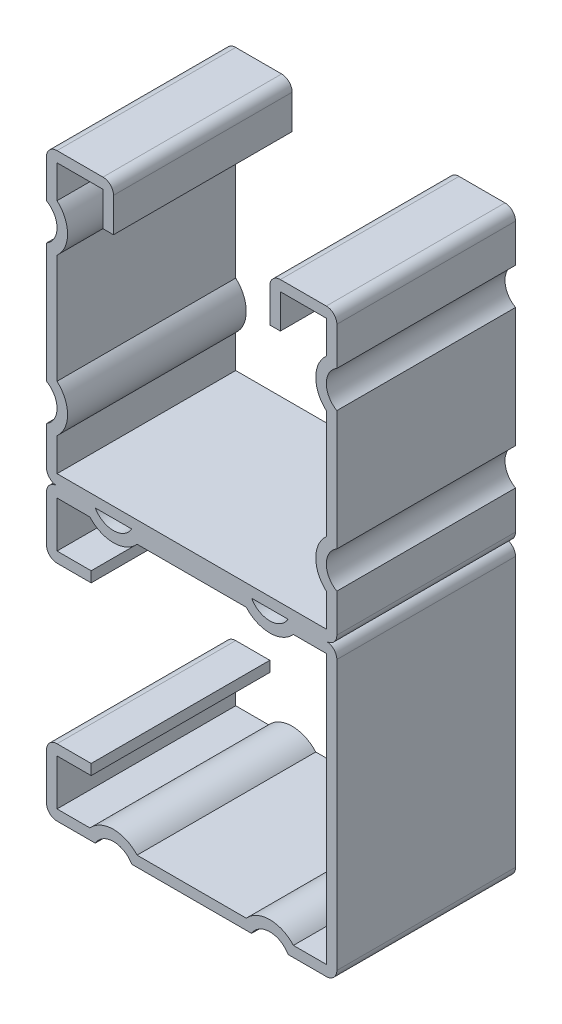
ISO-10303-21;
HEADER;
FILE_DESCRIPTION(('STEP AP214'),'2;1');
FILE_NAME('part.step','',(''),(''),'','','');
FILE_SCHEMA(('AUTOMOTIVE_DESIGN { 1 0 10303 214 1 1 1 1 }'));
ENDSEC;
DATA;
#1=APPLICATION_CONTEXT('core data for automotive mechanical design processes');
#2=APPLICATION_PROTOCOL_DEFINITION('international standard','automotive_design',2000,#1);
#3=PRODUCT_CONTEXT('',#1,'mechanical');
#4=PRODUCT('Part','Part','',(#3));
#5=PRODUCT_RELATED_PRODUCT_CATEGORY('part','',(#4));
#6=PRODUCT_DEFINITION_FORMATION('','',#4);
#7=PRODUCT_DEFINITION_CONTEXT('part definition',#1,'design');
#8=PRODUCT_DEFINITION('design','',#6,#7);
#9=PRODUCT_DEFINITION_SHAPE('','',#8);
#10=(LENGTH_UNIT() NAMED_UNIT(*) SI_UNIT(.MILLI.,.METRE.));
#11=(NAMED_UNIT(*) PLANE_ANGLE_UNIT() SI_UNIT($,.RADIAN.));
#12=(NAMED_UNIT(*) SI_UNIT($,.STERADIAN.) SOLID_ANGLE_UNIT());
#13=UNCERTAINTY_MEASURE_WITH_UNIT(LENGTH_MEASURE(1.E-05),#10,'distance_accuracy_value','');
#14=(GEOMETRIC_REPRESENTATION_CONTEXT(3) GLOBAL_UNCERTAINTY_ASSIGNED_CONTEXT((#13)) GLOBAL_UNIT_ASSIGNED_CONTEXT((#10,
#11,#12)) REPRESENTATION_CONTEXT('',''));
#15=CARTESIAN_POINT('',(0.,0.,0.));
#16=DIRECTION('',(0.,0.,1.));
#17=DIRECTION('',(1.,0.,0.));
#18=AXIS2_PLACEMENT_3D('',#15,#16,#17);
#19=CARTESIAN_POINT('',(-39.7764,0.,12.7));
#20=DIRECTION('',(0.,1.,0.));
#21=DIRECTION('',(0.,0.,1.));
#22=AXIS2_PLACEMENT_3D('',#19,#20,#21);
#23=PLANE('',#22);
#24=DIRECTION('',(0.,0.,-1.));
#25=VECTOR('',#24,1.);
#26=CARTESIAN_POINT('',(-6.92934865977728,0.,12.7));
#27=LINE('',#26,#25);
#28=CARTESIAN_POINT('',(-6.92934865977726,0.,12.7));
#29=VERTEX_POINT('',#28);
#30=CARTESIAN_POINT('',(-6.92934865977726,0.,-12.7));
#31=VERTEX_POINT('',#30);
#32=EDGE_CURVE('E54',#29,#31,#27,.T.);
#33=ORIENTED_EDGE('',*,*,#32,.F.);
#34=DIRECTION('',(1.,0.,0.));
#35=VECTOR('',#34,1.);
#36=CARTESIAN_POINT('',(-39.7764,0.,12.7));
#37=LINE('',#36,#35);
#38=CARTESIAN_POINT('',(-12.1206513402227,0.,12.7));
#39=VERTEX_POINT('',#38);
#40=EDGE_CURVE('E58',#39,#29,#37,.T.);
#41=ORIENTED_EDGE('',*,*,#40,.F.);
#42=DIRECTION('',(0.,0.,-1.));
#43=VECTOR('',#42,1.);
#44=CARTESIAN_POINT('',(-12.1206513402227,0.,12.7));
#45=LINE('',#44,#43);
#46=CARTESIAN_POINT('',(-12.1206513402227,0.,-12.7));
#47=VERTEX_POINT('',#46);
#48=EDGE_CURVE('E1045',#39,#47,#45,.T.);
#49=ORIENTED_EDGE('',*,*,#48,.T.);
#50=DIRECTION('',(1.,0.,0.));
#51=VECTOR('',#50,1.);
#52=CARTESIAN_POINT('',(-39.7764,0.,-12.7));
#53=LINE('',#52,#51);
#54=EDGE_CURVE('E637',#47,#31,#53,.T.);
#55=ORIENTED_EDGE('',*,*,#54,.T.);
#56=EDGE_LOOP('',(#33,#41,#49,#55));
#57=FACE_BOUND('',#56,.T.);
#58=ADVANCED_FACE('F39',(#57),#23,.F.);
#59=DIRECTION('',(0.,0.,-1.));
#60=VECTOR('',#59,1.);
#61=CARTESIAN_POINT('',(-29.1543486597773,-1.06345513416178E-13,12.7));
#62=LINE('',#61,#60);
#63=CARTESIAN_POINT('',(-29.1543486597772,0.,12.7));
#64=VERTEX_POINT('',#63);
#65=CARTESIAN_POINT('',(-29.1543486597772,0.,-12.7));
#66=VERTEX_POINT('',#65);
#67=EDGE_CURVE('E1042',#64,#66,#62,.T.);
#68=ORIENTED_EDGE('',*,*,#67,.F.);
#69=CARTESIAN_POINT('',(-34.3456513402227,0.,12.7));
#70=VERTEX_POINT('',#69);
#71=EDGE_CURVE('E564',#70,#64,#37,.T.);
#72=ORIENTED_EDGE('',*,*,#71,.F.);
#73=DIRECTION('',(0.,0.,-1.));
#74=VECTOR('',#73,1.);
#75=CARTESIAN_POINT('',(-34.3456513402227,-1.24037168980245E-13,12.7));
#76=LINE('',#75,#74);
#77=CARTESIAN_POINT('',(-34.3456513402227,-1.24037168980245E-13,-12.7));
#78=VERTEX_POINT('',#77);
#79=EDGE_CURVE('E1039',#70,#78,#76,.T.);
#80=ORIENTED_EDGE('',*,*,#79,.T.);
#81=EDGE_CURVE('E639',#78,#66,#53,.T.);
#82=ORIENTED_EDGE('',*,*,#81,.T.);
#83=EDGE_LOOP('',(#68,#72,#80,#82));
#84=FACE_BOUND('',#83,.T.);
#85=ADVANCED_FACE('F1243',(#84),#23,.F.);
#86=CARTESIAN_POINT('',(-39.7764,39.7764,12.7));
#87=DIRECTION('',(-1.,0.,0.));
#88=DIRECTION('',(0.,0.,1.));
#89=AXIS2_PLACEMENT_3D('',#86,#87,#88);
#90=PLANE('',#89);
#91=DIRECTION('',(0.,1.,0.));
#92=VECTOR('',#91,1.);
#93=CARTESIAN_POINT('',(-39.7764,39.7764,-12.7));
#94=LINE('',#93,#92);
#95=CARTESIAN_POINT('',(-39.7764,35.1009714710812,-12.7));
#96=VERTEX_POINT('',#95);
#97=CARTESIAN_POINT('',(-39.7764,39.7764,-12.7));
#98=VERTEX_POINT('',#97);
#99=EDGE_CURVE('E525',#96,#98,#94,.T.);
#100=ORIENTED_EDGE('',*,*,#99,.T.);
#101=DIRECTION('',(0.,0.,-1.));
#102=VECTOR('',#101,1.);
#103=CARTESIAN_POINT('',(-39.7764,39.7764,12.7));
#104=LINE('',#103,#102);
#105=CARTESIAN_POINT('',(-39.7764,39.7764,12.7));
#106=VERTEX_POINT('',#105);
#107=EDGE_CURVE('E11',#106,#98,#104,.T.);
#108=ORIENTED_EDGE('',*,*,#107,.F.);
#109=DIRECTION('',(0.,1.,0.));
#110=VECTOR('',#109,1.);
#111=CARTESIAN_POINT('',(-39.7764,39.7764,12.7));
#112=LINE('',#111,#110);
#113=CARTESIAN_POINT('',(-39.7764,35.1009714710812,12.7));
#114=VERTEX_POINT('',#113);
#115=EDGE_CURVE('E534',#114,#106,#112,.T.);
#116=ORIENTED_EDGE('',*,*,#115,.F.);
#117=DIRECTION('',(0.,0.,-1.));
#118=VECTOR('',#117,1.);
#119=CARTESIAN_POINT('',(-39.7764,35.1009714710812,12.7));
#120=LINE('',#119,#118);
#121=EDGE_CURVE('E610',#114,#96,#120,.T.);
#122=ORIENTED_EDGE('',*,*,#121,.T.);
#123=EDGE_LOOP('',(#100,#108,#116,#122));
#124=FACE_BOUND('',#123,.T.);
#125=ADVANCED_FACE('F41',(#124),#90,.F.);
#126=CARTESIAN_POINT('',(-39.7764,39.7764,12.7));
#127=DIRECTION('',(0.,1.,0.));
#128=DIRECTION('',(-1.,0.,0.));
#129=AXIS2_PLACEMENT_3D('',#126,#127,#128);
#130=PLANE('',#129);
#131=DIRECTION('',(1.,0.,0.));
#132=VECTOR('',#131,1.);
#133=CARTESIAN_POINT('',(-39.7764,39.7764,-12.7));
#134=LINE('',#133,#132);
#135=CARTESIAN_POINT('',(-33.2486,39.7764,-12.7));
#136=VERTEX_POINT('',#135);
#137=EDGE_CURVE('E528',#98,#136,#134,.T.);
#138=ORIENTED_EDGE('',*,*,#137,.T.);
#139=DIRECTION('',(0.,0.,-1.));
#140=VECTOR('',#139,1.);
#141=CARTESIAN_POINT('',(-33.2486,39.7764,12.7));
#142=LINE('',#141,#140);
#143=CARTESIAN_POINT('',(-33.2486,39.7764,12.7));
#144=VERTEX_POINT('',#143);
#145=EDGE_CURVE('E47',#144,#136,#142,.T.);
#146=ORIENTED_EDGE('',*,*,#145,.F.);
#147=DIRECTION('',(1.,0.,0.));
#148=VECTOR('',#147,1.);
#149=CARTESIAN_POINT('',(-39.7764,39.7764,12.7));
#150=LINE('',#149,#148);
#151=EDGE_CURVE('E536',#106,#144,#150,.T.);
#152=ORIENTED_EDGE('',*,*,#151,.F.);
#153=ORIENTED_EDGE('',*,*,#107,.T.);
#154=EDGE_LOOP('',(#138,#146,#152,#153));
#155=FACE_BOUND('',#154,.T.);
#156=ADVANCED_FACE('F817',(#155),#130,.F.);
#157=CARTESIAN_POINT('',(-33.2486,39.7764,12.7));
#158=DIRECTION('',(1.,0.,0.));
#159=DIRECTION('',(0.,0.,-1.));
#160=AXIS2_PLACEMENT_3D('',#157,#158,#159);
#161=PLANE('',#160);
#162=DIRECTION('',(0.,-1.,0.));
#163=VECTOR('',#162,1.);
#164=CARTESIAN_POINT('',(-33.2486,39.7764,-12.7));
#165=LINE('',#164,#163);
#166=CARTESIAN_POINT('',(-33.2486,34.925,-12.7));
#167=VERTEX_POINT('',#166);
#168=EDGE_CURVE('E613',#136,#167,#165,.T.);
#169=ORIENTED_EDGE('',*,*,#168,.T.);
#170=DIRECTION('',(0.,0.,-1.));
#171=VECTOR('',#170,1.);
#172=CARTESIAN_POINT('',(-33.2486,34.925,12.7));
#173=LINE('',#172,#171);
#174=CARTESIAN_POINT('',(-33.2486,34.925,12.7));
#175=VERTEX_POINT('',#174);
#176=EDGE_CURVE('E789',#175,#167,#173,.T.);
#177=ORIENTED_EDGE('',*,*,#176,.F.);
#178=DIRECTION('',(0.,-1.,0.));
#179=VECTOR('',#178,1.);
#180=CARTESIAN_POINT('',(-33.2486,39.7764,12.7));
#181=LINE('',#180,#179);
#182=EDGE_CURVE('E539',#144,#175,#181,.T.);
#183=ORIENTED_EDGE('',*,*,#182,.F.);
#184=ORIENTED_EDGE('',*,*,#145,.T.);
#185=EDGE_LOOP('',(#169,#177,#183,#184));
#186=FACE_BOUND('',#185,.T.);
#187=ADVANCED_FACE('F796',(#186),#161,.F.);
#188=CARTESIAN_POINT('',(-33.2486,34.925,12.7));
#189=DIRECTION('',(0.,1.,0.));
#190=DIRECTION('',(0.,0.,1.));
#191=AXIS2_PLACEMENT_3D('',#188,#189,#190);
#192=PLANE('',#191);
#193=DIRECTION('',(1.,0.,0.));
#194=VECTOR('',#193,1.);
#195=CARTESIAN_POINT('',(-33.2486,34.925,-12.7));
#196=LINE('',#195,#194);
#197=CARTESIAN_POINT('',(-31.75,34.925,-12.7));
#198=VERTEX_POINT('',#197);
#199=EDGE_CURVE('E615',#167,#198,#196,.T.);
#200=ORIENTED_EDGE('',*,*,#199,.T.);
#201=DIRECTION('',(0.,0.,-1.));
#202=VECTOR('',#201,1.);
#203=CARTESIAN_POINT('',(-31.75,34.925,12.7));
#204=LINE('',#203,#202);
#205=CARTESIAN_POINT('',(-31.75,34.925,12.7));
#206=VERTEX_POINT('',#205);
#207=EDGE_CURVE('E786',#206,#198,#204,.T.);
#208=ORIENTED_EDGE('',*,*,#207,.F.);
#209=DIRECTION('',(1.,0.,0.));
#210=VECTOR('',#209,1.);
#211=CARTESIAN_POINT('',(-33.2486,34.925,12.7));
#212=LINE('',#211,#210);
#213=EDGE_CURVE('E541',#175,#206,#212,.T.);
#214=ORIENTED_EDGE('',*,*,#213,.F.);
#215=ORIENTED_EDGE('',*,*,#176,.T.);
#216=EDGE_LOOP('',(#200,#208,#214,#215));
#217=FACE_BOUND('',#216,.T.);
#218=ADVANCED_FACE('F807',(#217),#192,.F.);
#219=CARTESIAN_POINT('',(-31.75,39.7764,12.7));
#220=DIRECTION('',(-1.,0.,0.));
#221=DIRECTION('',(0.,0.,1.));
#222=AXIS2_PLACEMENT_3D('',#219,#220,#221);
#223=PLANE('',#222);
#224=DIRECTION('',(0.,1.,0.));
#225=VECTOR('',#224,1.);
#226=CARTESIAN_POINT('',(-31.75,39.7764,-12.7));
#227=LINE('',#226,#225);
#228=CARTESIAN_POINT('',(-31.75,39.7764,-12.7));
#229=VERTEX_POINT('',#228);
#230=EDGE_CURVE('E617',#198,#229,#227,.T.);
#231=ORIENTED_EDGE('',*,*,#230,.T.);
#232=DIRECTION('',(0.,0.,-1.));
#233=VECTOR('',#232,1.);
#234=CARTESIAN_POINT('',(-31.75,39.7764,12.7));
#235=LINE('',#234,#233);
#236=CARTESIAN_POINT('',(-31.75,39.7764,12.7));
#237=VERTEX_POINT('',#236);
#238=EDGE_CURVE('E783',#237,#229,#235,.T.);
#239=ORIENTED_EDGE('',*,*,#238,.F.);
#240=DIRECTION('',(0.,1.,0.));
#241=VECTOR('',#240,1.);
#242=CARTESIAN_POINT('',(-31.75,39.7764,12.7));
#243=LINE('',#242,#241);
#244=EDGE_CURVE('E543',#206,#237,#243,.T.);
#245=ORIENTED_EDGE('',*,*,#244,.F.);
#246=ORIENTED_EDGE('',*,*,#207,.T.);
#247=EDGE_LOOP('',(#231,#239,#245,#246));
#248=FACE_BOUND('',#247,.T.);
#249=ADVANCED_FACE('F811',(#248),#223,.F.);
#250=CARTESIAN_POINT('',(-33.2486,39.7764,12.7));
#251=DIRECTION('',(0.,0.,-1.));
#252=DIRECTION('',(-1.,0.,0.));
#253=AXIS2_PLACEMENT_3D('',#250,#251,#252);
#254=CYLINDRICAL_SURFACE('',#253,1.4986);
#255=CARTESIAN_POINT('',(-33.2486,39.7764,-12.7));
#256=DIRECTION('',(0.,0.,1.));
#257=DIRECTION('',(-1.,0.,0.));
#258=AXIS2_PLACEMENT_3D('',#255,#256,#257);
#259=CIRCLE('',#258,1.4986);
#260=CARTESIAN_POINT('',(-33.2486,41.275,-12.7));
#261=VERTEX_POINT('',#260);
#262=EDGE_CURVE('E619',#229,#261,#259,.T.);
#263=ORIENTED_EDGE('',*,*,#262,.T.);
#264=DIRECTION('',(0.,0.,-1.));
#265=VECTOR('',#264,1.);
#266=CARTESIAN_POINT('',(-33.2486,41.275,12.7));
#267=LINE('',#266,#265);
#268=CARTESIAN_POINT('',(-33.2486,41.275,12.7));
#269=VERTEX_POINT('',#268);
#270=EDGE_CURVE('E780',#269,#261,#267,.T.);
#271=ORIENTED_EDGE('',*,*,#270,.F.);
#272=CARTESIAN_POINT('',(-33.2486,39.7764,12.7));
#273=DIRECTION('',(0.,0.,1.));
#274=DIRECTION('',(-1.,0.,0.));
#275=AXIS2_PLACEMENT_3D('',#272,#273,#274);
#276=CIRCLE('',#275,1.4986);
#277=EDGE_CURVE('E545',#237,#269,#276,.T.);
#278=ORIENTED_EDGE('',*,*,#277,.F.);
#279=ORIENTED_EDGE('',*,*,#238,.T.);
#280=EDGE_LOOP('',(#263,#271,#278,#279));
#281=FACE_BOUND('',#280,.T.);
#282=ADVANCED_FACE('F1284',(#281),#254,.T.);
#283=CARTESIAN_POINT('',(-39.7764,41.275,12.7));
#284=DIRECTION('',(0.,-1.,0.));
#285=DIRECTION('',(0.,0.,-1.));
#286=AXIS2_PLACEMENT_3D('',#283,#284,#285);
#287=PLANE('',#286);
#288=DIRECTION('',(-1.,0.,0.));
#289=VECTOR('',#288,1.);
#290=CARTESIAN_POINT('',(-39.7764,41.275,-12.7));
#291=LINE('',#290,#289);
#292=CARTESIAN_POINT('',(-39.7764,41.275,-12.7));
#293=VERTEX_POINT('',#292);
#294=EDGE_CURVE('E621',#261,#293,#291,.T.);
#295=ORIENTED_EDGE('',*,*,#294,.T.);
#296=DIRECTION('',(0.,0.,-1.));
#297=VECTOR('',#296,1.);
#298=CARTESIAN_POINT('',(-39.7764,41.275,12.7));
#299=LINE('',#298,#297);
#300=CARTESIAN_POINT('',(-39.7764,41.275,12.7));
#301=VERTEX_POINT('',#300);
#302=EDGE_CURVE('E777',#301,#293,#299,.T.);
#303=ORIENTED_EDGE('',*,*,#302,.F.);
#304=DIRECTION('',(-1.,0.,0.));
#305=VECTOR('',#304,1.);
#306=CARTESIAN_POINT('',(-39.7764,41.275,12.7));
#307=LINE('',#306,#305);
#308=EDGE_CURVE('E547',#269,#301,#307,.T.);
#309=ORIENTED_EDGE('',*,*,#308,.F.);
#310=ORIENTED_EDGE('',*,*,#270,.T.);
#311=EDGE_LOOP('',(#295,#303,#309,#310));
#312=FACE_BOUND('',#311,.T.);
#313=ADVANCED_FACE('F1280',(#312),#287,.F.);
#314=CARTESIAN_POINT('',(-39.7764,39.7764,12.7));
#315=DIRECTION('',(0.,0.,-1.));
#316=DIRECTION('',(-1.,0.,0.));
#317=AXIS2_PLACEMENT_3D('',#314,#315,#316);
#318=CYLINDRICAL_SURFACE('',#317,1.49860000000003);
#319=CARTESIAN_POINT('',(-39.7764,39.7764,-12.7));
#320=DIRECTION('',(0.,0.,1.));
#321=DIRECTION('',(-1.,0.,0.));
#322=AXIS2_PLACEMENT_3D('',#319,#320,#321);
#323=CIRCLE('',#322,1.49860000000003);
#324=CARTESIAN_POINT('',(-41.275,39.7764,-12.7));
#325=VERTEX_POINT('',#324);
#326=EDGE_CURVE('E623',#293,#325,#323,.T.);
#327=ORIENTED_EDGE('',*,*,#326,.T.);
#328=DIRECTION('',(0.,0.,-1.));
#329=VECTOR('',#328,1.);
#330=CARTESIAN_POINT('',(-41.275,39.7764,12.7));
#331=LINE('',#330,#329);
#332=CARTESIAN_POINT('',(-41.275,39.7764,12.7));
#333=VERTEX_POINT('',#332);
#334=EDGE_CURVE('E774',#333,#325,#331,.T.);
#335=ORIENTED_EDGE('',*,*,#334,.F.);
#336=CARTESIAN_POINT('',(-39.7764,39.7764,12.7));
#337=DIRECTION('',(0.,0.,1.));
#338=DIRECTION('',(-1.,0.,0.));
#339=AXIS2_PLACEMENT_3D('',#336,#337,#338);
#340=CIRCLE('',#339,1.49860000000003);
#341=EDGE_CURVE('E549',#301,#333,#340,.T.);
#342=ORIENTED_EDGE('',*,*,#341,.F.);
#343=ORIENTED_EDGE('',*,*,#302,.T.);
#344=EDGE_LOOP('',(#327,#335,#342,#343));
#345=FACE_BOUND('',#344,.T.);
#346=ADVANCED_FACE('F1276',(#345),#318,.T.);
#347=CARTESIAN_POINT('',(-41.275,39.7764,12.7));
#348=DIRECTION('',(1.,0.,0.));
#349=DIRECTION('',(0.,0.,-1.));
#350=AXIS2_PLACEMENT_3D('',#347,#348,#349);
#351=PLANE('',#350);
#352=DIRECTION('',(0.,-1.,0.));
#353=VECTOR('',#352,1.);
#354=CARTESIAN_POINT('',(-41.275,39.7764,-12.7));
#355=LINE('',#354,#353);
#356=CARTESIAN_POINT('',(-41.275,34.3456513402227,-12.7));
#357=VERTEX_POINT('',#356);
#358=EDGE_CURVE('E625',#325,#357,#355,.T.);
#359=ORIENTED_EDGE('',*,*,#358,.T.);
#360=DIRECTION('',(0.,0.,-1.));
#361=VECTOR('',#360,1.);
#362=CARTESIAN_POINT('',(-41.275,34.3456513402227,12.7));
#363=LINE('',#362,#361);
#364=CARTESIAN_POINT('',(-41.275,34.3456513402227,12.7));
#365=VERTEX_POINT('',#364);
#366=EDGE_CURVE('E771',#365,#357,#363,.T.);
#367=ORIENTED_EDGE('',*,*,#366,.F.);
#368=DIRECTION('',(0.,-1.,0.));
#369=VECTOR('',#368,1.);
#370=CARTESIAN_POINT('',(-41.275,39.7764,12.7));
#371=LINE('',#370,#369);
#372=EDGE_CURVE('E551',#333,#365,#371,.T.);
#373=ORIENTED_EDGE('',*,*,#372,.F.);
#374=ORIENTED_EDGE('',*,*,#334,.T.);
#375=EDGE_LOOP('',(#359,#367,#373,#374));
#376=FACE_BOUND('',#375,.T.);
#377=ADVANCED_FACE('F1272',(#376),#351,.F.);
#378=CARTESIAN_POINT('',(-42.7736,31.75,12.7));
#379=DIRECTION('',(0.,0.,-1.));
#380=DIRECTION('',(-1.,0.,0.));
#381=AXIS2_PLACEMENT_3D('',#378,#379,#380);
#382=CYLINDRICAL_SURFACE('',#381,2.9972);
#383=CARTESIAN_POINT('',(-42.7736,31.75,-12.7));
#384=DIRECTION('',(0.,0.,-1.));
#385=DIRECTION('',(1.,0.,0.));
#386=AXIS2_PLACEMENT_3D('',#383,#384,#385);
#387=CIRCLE('',#386,2.9972);
#388=CARTESIAN_POINT('',(-41.275,29.1543486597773,-12.7));
#389=VERTEX_POINT('',#388);
#390=EDGE_CURVE('E627',#357,#389,#387,.T.);
#391=ORIENTED_EDGE('',*,*,#390,.T.);
#392=DIRECTION('',(0.,0.,-1.));
#393=VECTOR('',#392,1.);
#394=CARTESIAN_POINT('',(-41.275,29.1543486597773,12.7));
#395=LINE('',#394,#393);
#396=CARTESIAN_POINT('',(-41.275,29.1543486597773,12.7));
#397=VERTEX_POINT('',#396);
#398=EDGE_CURVE('E768',#397,#389,#395,.T.);
#399=ORIENTED_EDGE('',*,*,#398,.F.);
#400=CARTESIAN_POINT('',(-42.7736,31.75,12.7));
#401=DIRECTION('',(0.,0.,-1.));
#402=DIRECTION('',(1.,0.,0.));
#403=AXIS2_PLACEMENT_3D('',#400,#401,#402);
#404=CIRCLE('',#403,2.9972);
#405=EDGE_CURVE('E553',#365,#397,#404,.T.);
#406=ORIENTED_EDGE('',*,*,#405,.F.);
#407=ORIENTED_EDGE('',*,*,#366,.T.);
#408=EDGE_LOOP('',(#391,#399,#406,#407));
#409=FACE_BOUND('',#408,.T.);
#410=ADVANCED_FACE('F1268',(#409),#382,.F.);
#411=CARTESIAN_POINT('',(-41.275,29.1543486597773,12.7));
#412=DIRECTION('',(1.,0.,0.));
#413=DIRECTION('',(0.,0.,-1.));
#414=AXIS2_PLACEMENT_3D('',#411,#412,#413);
#415=PLANE('',#414);
#416=DIRECTION('',(0.,-1.,0.));
#417=VECTOR('',#416,1.);
#418=CARTESIAN_POINT('',(-41.275,29.1543486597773,-12.7));
#419=LINE('',#418,#417);
#420=CARTESIAN_POINT('',(-41.275,12.1206513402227,-12.7));
#421=VERTEX_POINT('',#420);
#422=EDGE_CURVE('E629',#389,#421,#419,.T.);
#423=ORIENTED_EDGE('',*,*,#422,.T.);
#424=DIRECTION('',(0.,0.,-1.));
#425=VECTOR('',#424,1.);
#426=CARTESIAN_POINT('',(-41.275,12.1206513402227,12.7));
#427=LINE('',#426,#425);
#428=CARTESIAN_POINT('',(-41.275,12.1206513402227,12.7));
#429=VERTEX_POINT('',#428);
#430=EDGE_CURVE('E765',#429,#421,#427,.T.);
#431=ORIENTED_EDGE('',*,*,#430,.F.);
#432=DIRECTION('',(0.,-1.,0.));
#433=VECTOR('',#432,1.);
#434=CARTESIAN_POINT('',(-41.275,29.1543486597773,12.7));
#435=LINE('',#434,#433);
#436=EDGE_CURVE('E555',#397,#429,#435,.T.);
#437=ORIENTED_EDGE('',*,*,#436,.F.);
#438=ORIENTED_EDGE('',*,*,#398,.T.);
#439=EDGE_LOOP('',(#423,#431,#437,#438));
#440=FACE_BOUND('',#439,.T.);
#441=ADVANCED_FACE('F1264',(#440),#415,.F.);
#442=CARTESIAN_POINT('',(-42.7736,9.525,12.7));
#443=DIRECTION('',(0.,0.,-1.));
#444=DIRECTION('',(-1.,0.,0.));
#445=AXIS2_PLACEMENT_3D('',#442,#443,#444);
#446=CYLINDRICAL_SURFACE('',#445,2.9972);
#447=CARTESIAN_POINT('',(-42.7736,9.525,-12.7));
#448=DIRECTION('',(0.,0.,-1.));
#449=DIRECTION('',(-1.,0.,0.));
#450=AXIS2_PLACEMENT_3D('',#447,#448,#449);
#451=CIRCLE('',#450,2.9972);
#452=CARTESIAN_POINT('',(-41.275,6.92934865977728,-12.7));
#453=VERTEX_POINT('',#452);
#454=EDGE_CURVE('E631',#421,#453,#451,.T.);
#455=ORIENTED_EDGE('',*,*,#454,.T.);
#456=DIRECTION('',(0.,0.,-1.));
#457=VECTOR('',#456,1.);
#458=CARTESIAN_POINT('',(-41.275,6.92934865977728,12.7));
#459=LINE('',#458,#457);
#460=CARTESIAN_POINT('',(-41.275,6.92934865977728,12.7));
#461=VERTEX_POINT('',#460);
#462=EDGE_CURVE('E762',#461,#453,#459,.T.);
#463=ORIENTED_EDGE('',*,*,#462,.F.);
#464=CARTESIAN_POINT('',(-42.7736,9.525,12.7));
#465=DIRECTION('',(0.,0.,-1.));
#466=DIRECTION('',(-1.,0.,0.));
#467=AXIS2_PLACEMENT_3D('',#464,#465,#466);
#468=CIRCLE('',#467,2.9972);
#469=EDGE_CURVE('E557',#429,#461,#468,.T.);
#470=ORIENTED_EDGE('',*,*,#469,.F.);
#471=ORIENTED_EDGE('',*,*,#430,.T.);
#472=EDGE_LOOP('',(#455,#463,#470,#471));
#473=FACE_BOUND('',#472,.T.);
#474=ADVANCED_FACE('F1260',(#473),#446,.F.);
#475=CARTESIAN_POINT('',(-41.275,6.92934865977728,12.7));
#476=DIRECTION('',(1.,0.,0.));
#477=DIRECTION('',(0.,1.,0.));
#478=AXIS2_PLACEMENT_3D('',#475,#476,#477);
#479=PLANE('',#478);
#480=DIRECTION('',(0.,-1.,0.));
#481=VECTOR('',#480,1.);
#482=CARTESIAN_POINT('',(-41.275,6.92934865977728,-12.7));
#483=LINE('',#482,#481);
#484=CARTESIAN_POINT('',(-41.275,1.4986,-12.7));
#485=VERTEX_POINT('',#484);
#486=EDGE_CURVE('E633',#453,#485,#483,.T.);
#487=ORIENTED_EDGE('',*,*,#486,.T.);
#488=DIRECTION('',(0.,0.,-1.));
#489=VECTOR('',#488,1.);
#490=CARTESIAN_POINT('',(-41.275,1.4986,12.7));
#491=LINE('',#490,#489);
#492=CARTESIAN_POINT('',(-41.275,1.4986,12.7));
#493=VERTEX_POINT('',#492);
#494=EDGE_CURVE('E759',#493,#485,#491,.T.);
#495=ORIENTED_EDGE('',*,*,#494,.F.);
#496=DIRECTION('',(0.,-1.,0.));
#497=VECTOR('',#496,1.);
#498=CARTESIAN_POINT('',(-41.275,6.92934865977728,12.7));
#499=LINE('',#498,#497);
#500=EDGE_CURVE('E559',#461,#493,#499,.T.);
#501=ORIENTED_EDGE('',*,*,#500,.F.);
#502=ORIENTED_EDGE('',*,*,#462,.T.);
#503=EDGE_LOOP('',(#487,#495,#501,#502));
#504=FACE_BOUND('',#503,.T.);
#505=ADVANCED_FACE('F1256',(#504),#479,.F.);
#506=CARTESIAN_POINT('',(-39.7764,1.4986,12.7));
#507=DIRECTION('',(0.,0.,-1.));
#508=DIRECTION('',(-1.,0.,0.));
#509=AXIS2_PLACEMENT_3D('',#506,#507,#508);
#510=CYLINDRICAL_SURFACE('',#509,1.4986);
#511=CARTESIAN_POINT('',(-39.7764,1.4986,-12.7));
#512=DIRECTION('',(0.,0.,1.));
#513=DIRECTION('',(-1.,0.,0.));
#514=AXIS2_PLACEMENT_3D('',#511,#512,#513);
#515=CIRCLE('',#514,1.4986);
#516=CARTESIAN_POINT('',(-39.7764,0.,-12.7));
#517=VERTEX_POINT('',#516);
#518=EDGE_CURVE('E635',#485,#517,#515,.T.);
#519=ORIENTED_EDGE('',*,*,#518,.T.);
#520=DIRECTION('',(0.,0.,-1.));
#521=VECTOR('',#520,1.);
#522=CARTESIAN_POINT('',(-39.7764,0.,12.7));
#523=LINE('',#522,#521);
#524=CARTESIAN_POINT('',(-39.7764,0.,12.7));
#525=VERTEX_POINT('',#524);
#526=EDGE_CURVE('E756',#525,#517,#523,.T.);
#527=ORIENTED_EDGE('',*,*,#526,.F.);
#528=CARTESIAN_POINT('',(-39.7764,1.4986,12.7));
#529=DIRECTION('',(0.,0.,1.));
#530=DIRECTION('',(-1.,0.,0.));
#531=AXIS2_PLACEMENT_3D('',#528,#529,#530);
#532=CIRCLE('',#531,1.4986);
#533=EDGE_CURVE('E561',#493,#525,#532,.T.);
#534=ORIENTED_EDGE('',*,*,#533,.F.);
#535=ORIENTED_EDGE('',*,*,#494,.T.);
#536=EDGE_LOOP('',(#519,#527,#534,#535));
#537=FACE_BOUND('',#536,.T.);
#538=ADVANCED_FACE('F1253',(#537),#510,.T.);
#539=CARTESIAN_POINT('',(-1.49860000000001,1.4986,12.7));
#540=DIRECTION('',(0.,0.,-1.));
#541=DIRECTION('',(-1.,0.,0.));
#542=AXIS2_PLACEMENT_3D('',#539,#540,#541);
#543=CYLINDRICAL_SURFACE('',#542,1.4986);
#544=CARTESIAN_POINT('',(-1.49860000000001,1.4986,-12.7));
#545=DIRECTION('',(0.,0.,1.));
#546=DIRECTION('',(-1.,0.,0.));
#547=AXIS2_PLACEMENT_3D('',#544,#545,#546);
#548=CIRCLE('',#547,1.4986);
#549=CARTESIAN_POINT('',(-1.4986,0.,-12.7));
#550=VERTEX_POINT('',#549);
#551=CARTESIAN_POINT('',(0.,1.4986,-12.7));
#552=VERTEX_POINT('',#551);
#553=EDGE_CURVE('E640',#550,#552,#548,.T.);
#554=ORIENTED_EDGE('',*,*,#553,.T.);
#555=DIRECTION('',(0.,0.,-1.));
#556=VECTOR('',#555,1.);
#557=CARTESIAN_POINT('',(0.,1.4986,12.7));
#558=LINE('',#557,#556);
#559=CARTESIAN_POINT('',(0.,1.4986,12.7));
#560=VERTEX_POINT('',#559);
#561=EDGE_CURVE('E750',#560,#552,#558,.T.);
#562=ORIENTED_EDGE('',*,*,#561,.F.);
#563=CARTESIAN_POINT('',(-1.49860000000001,1.4986,12.7));
#564=DIRECTION('',(0.,0.,1.));
#565=DIRECTION('',(-1.,0.,0.));
#566=AXIS2_PLACEMENT_3D('',#563,#564,#565);
#567=CIRCLE('',#566,1.4986);
#568=CARTESIAN_POINT('',(-1.49860000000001,0.,12.7));
#569=VERTEX_POINT('',#568);
#570=EDGE_CURVE('E565',#569,#560,#567,.T.);
#571=ORIENTED_EDGE('',*,*,#570,.F.);
#572=DIRECTION('',(0.,0.,-1.));
#573=VECTOR('',#572,1.);
#574=CARTESIAN_POINT('',(-1.49860000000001,0.,12.7));
#575=LINE('',#574,#573);
#576=EDGE_CURVE('E753',#569,#550,#575,.T.);
#577=ORIENTED_EDGE('',*,*,#576,.T.);
#578=EDGE_LOOP('',(#554,#562,#571,#577));
#579=FACE_BOUND('',#578,.T.);
#580=ADVANCED_FACE('F932',(#579),#543,.T.);
#581=CARTESIAN_POINT('',(0.,1.4986,12.7));
#582=DIRECTION('',(-1.,0.,0.));
#583=DIRECTION('',(0.,0.,1.));
#584=AXIS2_PLACEMENT_3D('',#581,#582,#583);
#585=PLANE('',#584);
#586=DIRECTION('',(0.,1.,0.));
#587=VECTOR('',#586,1.);
#588=CARTESIAN_POINT('',(0.,1.4986,-12.7));
#589=LINE('',#588,#587);
#590=CARTESIAN_POINT('',(0.,6.92934865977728,-12.7));
#591=VERTEX_POINT('',#590);
#592=EDGE_CURVE('E642',#552,#591,#589,.T.);
#593=ORIENTED_EDGE('',*,*,#592,.T.);
#594=DIRECTION('',(0.,0.,-1.));
#595=VECTOR('',#594,1.);
#596=CARTESIAN_POINT('',(0.,6.92934865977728,12.7));
#597=LINE('',#596,#595);
#598=CARTESIAN_POINT('',(0.,6.92934865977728,12.7));
#599=VERTEX_POINT('',#598);
#600=EDGE_CURVE('E747',#599,#591,#597,.T.);
#601=ORIENTED_EDGE('',*,*,#600,.F.);
#602=DIRECTION('',(0.,1.,0.));
#603=VECTOR('',#602,1.);
#604=CARTESIAN_POINT('',(0.,1.4986,12.7));
#605=LINE('',#604,#603);
#606=EDGE_CURVE('E567',#560,#599,#605,.T.);
#607=ORIENTED_EDGE('',*,*,#606,.F.);
#608=ORIENTED_EDGE('',*,*,#561,.T.);
#609=EDGE_LOOP('',(#593,#601,#607,#608));
#610=FACE_BOUND('',#609,.T.);
#611=ADVANCED_FACE('F928',(#610),#585,.F.);
#612=CARTESIAN_POINT('',(1.49859999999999,9.525,12.7));
#613=DIRECTION('',(0.,0.,-1.));
#614=DIRECTION('',(-1.,0.,0.));
#615=AXIS2_PLACEMENT_3D('',#612,#613,#614);
#616=CYLINDRICAL_SURFACE('',#615,2.9972);
#617=CARTESIAN_POINT('',(1.49859999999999,9.525,-12.7));
#618=DIRECTION('',(0.,0.,-1.));
#619=DIRECTION('',(-1.,0.,0.));
#620=AXIS2_PLACEMENT_3D('',#617,#618,#619);
#621=CIRCLE('',#620,2.9972);
#622=CARTESIAN_POINT('',(0.,12.1206513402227,-12.7));
#623=VERTEX_POINT('',#622);
#624=EDGE_CURVE('E644',#591,#623,#621,.T.);
#625=ORIENTED_EDGE('',*,*,#624,.T.);
#626=DIRECTION('',(0.,0.,-1.));
#627=VECTOR('',#626,1.);
#628=CARTESIAN_POINT('',(0.,12.1206513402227,12.7));
#629=LINE('',#628,#627);
#630=CARTESIAN_POINT('',(0.,12.1206513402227,12.7));
#631=VERTEX_POINT('',#630);
#632=EDGE_CURVE('E744',#631,#623,#629,.T.);
#633=ORIENTED_EDGE('',*,*,#632,.F.);
#634=CARTESIAN_POINT('',(1.49859999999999,9.525,12.7));
#635=DIRECTION('',(0.,0.,-1.));
#636=DIRECTION('',(-1.,0.,0.));
#637=AXIS2_PLACEMENT_3D('',#634,#635,#636);
#638=CIRCLE('',#637,2.9972);
#639=EDGE_CURVE('E569',#599,#631,#638,.T.);
#640=ORIENTED_EDGE('',*,*,#639,.F.);
#641=ORIENTED_EDGE('',*,*,#600,.T.);
#642=EDGE_LOOP('',(#625,#633,#640,#641));
#643=FACE_BOUND('',#642,.T.);
#644=ADVANCED_FACE('F923',(#643),#616,.F.);
#645=CARTESIAN_POINT('',(0.,12.1206513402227,12.7));
#646=DIRECTION('',(-1.,0.,0.));
#647=DIRECTION('',(0.,-1.,0.));
#648=AXIS2_PLACEMENT_3D('',#645,#646,#647);
#649=PLANE('',#648);
#650=DIRECTION('',(0.,1.,0.));
#651=VECTOR('',#650,1.);
#652=CARTESIAN_POINT('',(0.,12.1206513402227,-12.7));
#653=LINE('',#652,#651);
#654=CARTESIAN_POINT('',(0.,29.1543486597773,-12.7));
#655=VERTEX_POINT('',#654);
#656=EDGE_CURVE('E646',#623,#655,#653,.T.);
#657=ORIENTED_EDGE('',*,*,#656,.T.);
#658=DIRECTION('',(0.,0.,-1.));
#659=VECTOR('',#658,1.);
#660=CARTESIAN_POINT('',(0.,29.1543486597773,12.7));
#661=LINE('',#660,#659);
#662=CARTESIAN_POINT('',(0.,29.1543486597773,12.7));
#663=VERTEX_POINT('',#662);
#664=EDGE_CURVE('E741',#663,#655,#661,.T.);
#665=ORIENTED_EDGE('',*,*,#664,.F.);
#666=DIRECTION('',(0.,1.,0.));
#667=VECTOR('',#666,1.);
#668=CARTESIAN_POINT('',(0.,12.1206513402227,12.7));
#669=LINE('',#668,#667);
#670=EDGE_CURVE('E571',#631,#663,#669,.T.);
#671=ORIENTED_EDGE('',*,*,#670,.F.);
#672=ORIENTED_EDGE('',*,*,#632,.T.);
#673=EDGE_LOOP('',(#657,#665,#671,#672));
#674=FACE_BOUND('',#673,.T.);
#675=ADVANCED_FACE('F919',(#674),#649,.F.);
#676=CARTESIAN_POINT('',(1.49859999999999,31.75,12.7));
#677=DIRECTION('',(0.,0.,-1.));
#678=DIRECTION('',(-1.,0.,0.));
#679=AXIS2_PLACEMENT_3D('',#676,#677,#678);
#680=CYLINDRICAL_SURFACE('',#679,2.9972);
#681=CARTESIAN_POINT('',(1.49859999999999,31.75,-12.7));
#682=DIRECTION('',(0.,0.,-1.));
#683=DIRECTION('',(1.,0.,0.));
#684=AXIS2_PLACEMENT_3D('',#681,#682,#683);
#685=CIRCLE('',#684,2.9972);
#686=CARTESIAN_POINT('',(0.,34.3456513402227,-12.7));
#687=VERTEX_POINT('',#686);
#688=EDGE_CURVE('E648',#655,#687,#685,.T.);
#689=ORIENTED_EDGE('',*,*,#688,.T.);
#690=DIRECTION('',(0.,0.,-1.));
#691=VECTOR('',#690,1.);
#692=CARTESIAN_POINT('',(0.,34.3456513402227,12.7));
#693=LINE('',#692,#691);
#694=CARTESIAN_POINT('',(0.,34.3456513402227,12.7));
#695=VERTEX_POINT('',#694);
#696=EDGE_CURVE('E738',#695,#687,#693,.T.);
#697=ORIENTED_EDGE('',*,*,#696,.F.);
#698=CARTESIAN_POINT('',(1.49859999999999,31.75,12.7));
#699=DIRECTION('',(0.,0.,-1.));
#700=DIRECTION('',(1.,0.,0.));
#701=AXIS2_PLACEMENT_3D('',#698,#699,#700);
#702=CIRCLE('',#701,2.9972);
#703=EDGE_CURVE('E573',#663,#695,#702,.T.);
#704=ORIENTED_EDGE('',*,*,#703,.F.);
#705=ORIENTED_EDGE('',*,*,#664,.T.);
#706=EDGE_LOOP('',(#689,#697,#704,#705));
#707=FACE_BOUND('',#706,.T.);
#708=ADVANCED_FACE('F914',(#707),#680,.F.);
#709=CARTESIAN_POINT('',(0.,34.3456513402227,12.7));
#710=DIRECTION('',(-1.,0.,0.));
#711=DIRECTION('',(0.,-1.,0.));
#712=AXIS2_PLACEMENT_3D('',#709,#710,#711);
#713=PLANE('',#712);
#714=DIRECTION('',(0.,1.,0.));
#715=VECTOR('',#714,1.);
#716=CARTESIAN_POINT('',(0.,34.3456513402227,-12.7));
#717=LINE('',#716,#715);
#718=CARTESIAN_POINT('',(0.,39.7764,-12.7));
#719=VERTEX_POINT('',#718);
#720=EDGE_CURVE('E650',#687,#719,#717,.T.);
#721=ORIENTED_EDGE('',*,*,#720,.T.);
#722=DIRECTION('',(0.,0.,-1.));
#723=VECTOR('',#722,1.);
#724=CARTESIAN_POINT('',(0.,39.7764,12.7));
#725=LINE('',#724,#723);
#726=CARTESIAN_POINT('',(0.,39.7764,12.7));
#727=VERTEX_POINT('',#726);
#728=EDGE_CURVE('E735',#727,#719,#725,.T.);
#729=ORIENTED_EDGE('',*,*,#728,.F.);
#730=DIRECTION('',(0.,1.,0.));
#731=VECTOR('',#730,1.);
#732=CARTESIAN_POINT('',(0.,34.3456513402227,12.7));
#733=LINE('',#732,#731);
#734=EDGE_CURVE('E575',#695,#727,#733,.T.);
#735=ORIENTED_EDGE('',*,*,#734,.F.);
#736=ORIENTED_EDGE('',*,*,#696,.T.);
#737=EDGE_LOOP('',(#721,#729,#735,#736));
#738=FACE_BOUND('',#737,.T.);
#739=ADVANCED_FACE('F908',(#738),#713,.F.);
#740=CARTESIAN_POINT('',(-1.49860000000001,39.7764,12.7));
#741=DIRECTION('',(0.,0.,-1.));
#742=DIRECTION('',(-1.,0.,0.));
#743=AXIS2_PLACEMENT_3D('',#740,#741,#742);
#744=CYLINDRICAL_SURFACE('',#743,1.4986);
#745=CARTESIAN_POINT('',(-1.49860000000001,39.7764,-12.7));
#746=DIRECTION('',(0.,0.,1.));
#747=DIRECTION('',(-1.,0.,0.));
#748=AXIS2_PLACEMENT_3D('',#745,#746,#747);
#749=CIRCLE('',#748,1.4986);
#750=CARTESIAN_POINT('',(-1.49860000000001,41.275,-12.7));
#751=VERTEX_POINT('',#750);
#752=EDGE_CURVE('E652',#719,#751,#749,.T.);
#753=ORIENTED_EDGE('',*,*,#752,.T.);
#754=DIRECTION('',(0.,0.,-1.));
#755=VECTOR('',#754,1.);
#756=CARTESIAN_POINT('',(-1.49860000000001,41.275,12.7));
#757=LINE('',#756,#755);
#758=CARTESIAN_POINT('',(-1.49860000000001,41.275,12.7));
#759=VERTEX_POINT('',#758);
#760=EDGE_CURVE('E732',#759,#751,#757,.T.);
#761=ORIENTED_EDGE('',*,*,#760,.F.);
#762=CARTESIAN_POINT('',(-1.49860000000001,39.7764,12.7));
#763=DIRECTION('',(0.,0.,1.));
#764=DIRECTION('',(-1.,0.,0.));
#765=AXIS2_PLACEMENT_3D('',#762,#763,#764);
#766=CIRCLE('',#765,1.4986);
#767=EDGE_CURVE('E577',#727,#759,#766,.T.);
#768=ORIENTED_EDGE('',*,*,#767,.F.);
#769=ORIENTED_EDGE('',*,*,#728,.T.);
#770=EDGE_LOOP('',(#753,#761,#768,#769));
#771=FACE_BOUND('',#770,.T.);
#772=ADVANCED_FACE('F904',(#771),#744,.T.);
#773=CARTESIAN_POINT('',(-1.49860000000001,41.275,12.7));
#774=DIRECTION('',(0.,-1.,0.));
#775=DIRECTION('',(1.,0.,0.));
#776=AXIS2_PLACEMENT_3D('',#773,#774,#775);
#777=PLANE('',#776);
#778=DIRECTION('',(-1.,0.,0.));
#779=VECTOR('',#778,1.);
#780=CARTESIAN_POINT('',(-1.49860000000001,41.275,-12.7));
#781=LINE('',#780,#779);
#782=CARTESIAN_POINT('',(-8.0264,41.275,-12.7));
#783=VERTEX_POINT('',#782);
#784=EDGE_CURVE('E654',#751,#783,#781,.T.);
#785=ORIENTED_EDGE('',*,*,#784,.T.);
#786=DIRECTION('',(0.,0.,-1.));
#787=VECTOR('',#786,1.);
#788=CARTESIAN_POINT('',(-8.0264,41.275,12.7));
#789=LINE('',#788,#787);
#790=CARTESIAN_POINT('',(-8.0264,41.275,12.7));
#791=VERTEX_POINT('',#790);
#792=EDGE_CURVE('E729',#791,#783,#789,.T.);
#793=ORIENTED_EDGE('',*,*,#792,.F.);
#794=DIRECTION('',(-1.,0.,0.));
#795=VECTOR('',#794,1.);
#796=CARTESIAN_POINT('',(-1.49860000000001,41.275,12.7));
#797=LINE('',#796,#795);
#798=EDGE_CURVE('E579',#759,#791,#797,.T.);
#799=ORIENTED_EDGE('',*,*,#798,.F.);
#800=ORIENTED_EDGE('',*,*,#760,.T.);
#801=EDGE_LOOP('',(#785,#793,#799,#800));
#802=FACE_BOUND('',#801,.T.);
#803=ADVANCED_FACE('F899',(#802),#777,.F.);
#804=CARTESIAN_POINT('',(-8.0264,39.7764,12.7));
#805=DIRECTION('',(0.,0.,-1.));
#806=DIRECTION('',(-1.,0.,0.));
#807=AXIS2_PLACEMENT_3D('',#804,#805,#806);
#808=CYLINDRICAL_SURFACE('',#807,1.49860000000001);
#809=CARTESIAN_POINT('',(-8.0264,39.7764,-12.7));
#810=DIRECTION('',(0.,0.,1.));
#811=DIRECTION('',(-1.,0.,0.));
#812=AXIS2_PLACEMENT_3D('',#809,#810,#811);
#813=CIRCLE('',#812,1.49860000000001);
#814=CARTESIAN_POINT('',(-9.52500000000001,39.7764,-12.7));
#815=VERTEX_POINT('',#814);
#816=EDGE_CURVE('E656',#783,#815,#813,.T.);
#817=ORIENTED_EDGE('',*,*,#816,.T.);
#818=DIRECTION('',(0.,0.,-1.));
#819=VECTOR('',#818,1.);
#820=CARTESIAN_POINT('',(-9.52500000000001,39.7764,12.7));
#821=LINE('',#820,#819);
#822=CARTESIAN_POINT('',(-9.52500000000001,39.7764,12.7));
#823=VERTEX_POINT('',#822);
#824=EDGE_CURVE('E726',#823,#815,#821,.T.);
#825=ORIENTED_EDGE('',*,*,#824,.F.);
#826=CARTESIAN_POINT('',(-8.0264,39.7764,12.7));
#827=DIRECTION('',(0.,0.,1.));
#828=DIRECTION('',(-1.,0.,0.));
#829=AXIS2_PLACEMENT_3D('',#826,#827,#828);
#830=CIRCLE('',#829,1.49860000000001);
#831=EDGE_CURVE('E581',#791,#823,#830,.T.);
#832=ORIENTED_EDGE('',*,*,#831,.F.);
#833=ORIENTED_EDGE('',*,*,#792,.T.);
#834=EDGE_LOOP('',(#817,#825,#832,#833));
#835=FACE_BOUND('',#834,.T.);
#836=ADVANCED_FACE('F893',(#835),#808,.T.);
#837=CARTESIAN_POINT('',(-9.525,39.7764,12.7));
#838=DIRECTION('',(1.,0.,0.));
#839=DIRECTION('',(0.,1.,0.));
#840=AXIS2_PLACEMENT_3D('',#837,#838,#839);
#841=PLANE('',#840);
#842=DIRECTION('',(0.,-1.,0.));
#843=VECTOR('',#842,1.);
#844=CARTESIAN_POINT('',(-9.525,39.7764,-12.7));
#845=LINE('',#844,#843);
#846=CARTESIAN_POINT('',(-9.525,34.925,-12.7));
#847=VERTEX_POINT('',#846);
#848=EDGE_CURVE('E658',#815,#847,#845,.T.);
#849=ORIENTED_EDGE('',*,*,#848,.T.);
#850=DIRECTION('',(0.,0.,-1.));
#851=VECTOR('',#850,1.);
#852=CARTESIAN_POINT('',(-9.525,34.925,12.7));
#853=LINE('',#852,#851);
#854=CARTESIAN_POINT('',(-9.525,34.925,12.7));
#855=VERTEX_POINT('',#854);
#856=EDGE_CURVE('E723',#855,#847,#853,.T.);
#857=ORIENTED_EDGE('',*,*,#856,.F.);
#858=DIRECTION('',(0.,-1.,0.));
#859=VECTOR('',#858,1.);
#860=CARTESIAN_POINT('',(-9.525,39.7764,12.7));
#861=LINE('',#860,#859);
#862=EDGE_CURVE('E583',#823,#855,#861,.T.);
#863=ORIENTED_EDGE('',*,*,#862,.F.);
#864=ORIENTED_EDGE('',*,*,#824,.T.);
#865=EDGE_LOOP('',(#849,#857,#863,#864));
#866=FACE_BOUND('',#865,.T.);
#867=ADVANCED_FACE('F889',(#866),#841,.F.);
#868=CARTESIAN_POINT('',(-9.525,34.925,12.7));
#869=DIRECTION('',(0.,1.,0.));
#870=DIRECTION('',(-1.,0.,0.));
#871=AXIS2_PLACEMENT_3D('',#868,#869,#870);
#872=PLANE('',#871);
#873=DIRECTION('',(1.,0.,0.));
#874=VECTOR('',#873,1.);
#875=CARTESIAN_POINT('',(-9.525,34.925,-12.7));
#876=LINE('',#875,#874);
#877=CARTESIAN_POINT('',(-8.0264,34.925,-12.7));
#878=VERTEX_POINT('',#877);
#879=EDGE_CURVE('E660',#847,#878,#876,.T.);
#880=ORIENTED_EDGE('',*,*,#879,.T.);
#881=DIRECTION('',(0.,0.,-1.));
#882=VECTOR('',#881,1.);
#883=CARTESIAN_POINT('',(-8.0264,34.925,12.7));
#884=LINE('',#883,#882);
#885=CARTESIAN_POINT('',(-8.0264,34.925,12.7));
#886=VERTEX_POINT('',#885);
#887=EDGE_CURVE('E720',#886,#878,#884,.T.);
#888=ORIENTED_EDGE('',*,*,#887,.F.);
#889=DIRECTION('',(1.,0.,0.));
#890=VECTOR('',#889,1.);
#891=CARTESIAN_POINT('',(-9.525,34.925,12.7));
#892=LINE('',#891,#890);
#893=EDGE_CURVE('E585',#855,#886,#892,.T.);
#894=ORIENTED_EDGE('',*,*,#893,.F.);
#895=ORIENTED_EDGE('',*,*,#856,.T.);
#896=EDGE_LOOP('',(#880,#888,#894,#895));
#897=FACE_BOUND('',#896,.T.);
#898=ADVANCED_FACE('F884',(#897),#872,.F.);
#899=CARTESIAN_POINT('',(-8.0264,39.7764,12.7));
#900=DIRECTION('',(-1.,0.,0.));
#901=DIRECTION('',(0.,-1.,0.));
#902=AXIS2_PLACEMENT_3D('',#899,#900,#901);
#903=PLANE('',#902);
#904=DIRECTION('',(0.,1.,0.));
#905=VECTOR('',#904,1.);
#906=CARTESIAN_POINT('',(-8.0264,39.7764,-12.7));
#907=LINE('',#906,#905);
#908=CARTESIAN_POINT('',(-8.0264,39.7764,-12.7));
#909=VERTEX_POINT('',#908);
#910=EDGE_CURVE('E662',#878,#909,#907,.T.);
#911=ORIENTED_EDGE('',*,*,#910,.T.);
#912=DIRECTION('',(0.,0.,-1.));
#913=VECTOR('',#912,1.);
#914=CARTESIAN_POINT('',(-8.0264,39.7764,12.7));
#915=LINE('',#914,#913);
#916=CARTESIAN_POINT('',(-8.0264,39.7764,12.7));
#917=VERTEX_POINT('',#916);
#918=EDGE_CURVE('E717',#917,#909,#915,.T.);
#919=ORIENTED_EDGE('',*,*,#918,.F.);
#920=DIRECTION('',(0.,1.,0.));
#921=VECTOR('',#920,1.);
#922=CARTESIAN_POINT('',(-8.0264,39.7764,12.7));
#923=LINE('',#922,#921);
#924=EDGE_CURVE('E587',#886,#917,#923,.T.);
#925=ORIENTED_EDGE('',*,*,#924,.F.);
#926=ORIENTED_EDGE('',*,*,#887,.T.);
#927=EDGE_LOOP('',(#911,#919,#925,#926));
#928=FACE_BOUND('',#927,.T.);
#929=ADVANCED_FACE('F878',(#928),#903,.F.);
#930=CARTESIAN_POINT('',(-1.49860000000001,39.7764,12.7));
#931=DIRECTION('',(0.,1.,0.));
#932=DIRECTION('',(-1.,0.,0.));
#933=AXIS2_PLACEMENT_3D('',#930,#931,#932);
#934=PLANE('',#933);
#935=DIRECTION('',(1.,0.,0.));
#936=VECTOR('',#935,1.);
#937=CARTESIAN_POINT('',(-1.49860000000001,39.7764,-12.7));
#938=LINE('',#937,#936);
#939=CARTESIAN_POINT('',(-1.49860000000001,39.7764,-12.7));
#940=VERTEX_POINT('',#939);
#941=EDGE_CURVE('E664',#909,#940,#938,.T.);
#942=ORIENTED_EDGE('',*,*,#941,.T.);
#943=DIRECTION('',(0.,0.,-1.));
#944=VECTOR('',#943,1.);
#945=CARTESIAN_POINT('',(-1.49860000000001,39.7764,12.7));
#946=LINE('',#945,#944);
#947=CARTESIAN_POINT('',(-1.49860000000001,39.7764,12.7));
#948=VERTEX_POINT('',#947);
#949=EDGE_CURVE('E714',#948,#940,#946,.T.);
#950=ORIENTED_EDGE('',*,*,#949,.F.);
#951=DIRECTION('',(1.,0.,0.));
#952=VECTOR('',#951,1.);
#953=CARTESIAN_POINT('',(-1.49860000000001,39.7764,12.7));
#954=LINE('',#953,#952);
#955=EDGE_CURVE('E589',#917,#948,#954,.T.);
#956=ORIENTED_EDGE('',*,*,#955,.F.);
#957=ORIENTED_EDGE('',*,*,#918,.T.);
#958=EDGE_LOOP('',(#942,#950,#956,#957));
#959=FACE_BOUND('',#958,.T.);
#960=ADVANCED_FACE('F874',(#959),#934,.F.);
#961=CARTESIAN_POINT('',(-1.4986,35.1009714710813,12.7));
#962=DIRECTION('',(1.,0.,0.));
#963=DIRECTION('',(0.,1.,0.));
#964=AXIS2_PLACEMENT_3D('',#961,#962,#963);
#965=PLANE('',#964);
#966=DIRECTION('',(0.,-1.,0.));
#967=VECTOR('',#966,1.);
#968=CARTESIAN_POINT('',(-1.4986,35.1009714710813,-12.7));
#969=LINE('',#968,#967);
#970=CARTESIAN_POINT('',(-1.4986,35.1009714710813,-12.7));
#971=VERTEX_POINT('',#970);
#972=EDGE_CURVE('E666',#940,#971,#969,.T.);
#973=ORIENTED_EDGE('',*,*,#972,.T.);
#974=DIRECTION('',(0.,0.,-1.));
#975=VECTOR('',#974,1.);
#976=CARTESIAN_POINT('',(-1.4986,35.1009714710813,12.7));
#977=LINE('',#976,#975);
#978=CARTESIAN_POINT('',(-1.4986,35.1009714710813,12.7));
#979=VERTEX_POINT('',#978);
#980=EDGE_CURVE('E711',#979,#971,#977,.T.);
#981=ORIENTED_EDGE('',*,*,#980,.F.);
#982=DIRECTION('',(0.,-1.,0.));
#983=VECTOR('',#982,1.);
#984=CARTESIAN_POINT('',(-1.4986,35.1009714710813,12.7));
#985=LINE('',#984,#983);
#986=EDGE_CURVE('E591',#948,#979,#985,.T.);
#987=ORIENTED_EDGE('',*,*,#986,.F.);
#988=ORIENTED_EDGE('',*,*,#949,.T.);
#989=EDGE_LOOP('',(#973,#981,#987,#988));
#990=FACE_BOUND('',#989,.T.);
#991=ADVANCED_FACE('F869',(#990),#965,.F.);
#992=CARTESIAN_POINT('',(1.49859999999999,31.75,12.7));
#993=DIRECTION('',(0.,0.,-1.));
#994=DIRECTION('',(-1.,0.,0.));
#995=AXIS2_PLACEMENT_3D('',#992,#993,#994);
#996=CYLINDRICAL_SURFACE('',#995,4.49580000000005);
#997=CARTESIAN_POINT('',(1.49859999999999,31.75,-12.7));
#998=DIRECTION('',(0.,0.,1.));
#999=DIRECTION('',(1.,0.,0.));
#1000=AXIS2_PLACEMENT_3D('',#997,#998,#999);
#1001=CIRCLE('',#1000,4.49580000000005);
#1002=CARTESIAN_POINT('',(-1.49860000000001,28.3990285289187,-12.7));
#1003=VERTEX_POINT('',#1002);
#1004=EDGE_CURVE('E668',#971,#1003,#1001,.T.);
#1005=ORIENTED_EDGE('',*,*,#1004,.T.);
#1006=DIRECTION('',(0.,0.,-1.));
#1007=VECTOR('',#1006,1.);
#1008=CARTESIAN_POINT('',(-1.49860000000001,28.3990285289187,12.7));
#1009=LINE('',#1008,#1007);
#1010=CARTESIAN_POINT('',(-1.49860000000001,28.3990285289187,12.7));
#1011=VERTEX_POINT('',#1010);
#1012=EDGE_CURVE('E708',#1011,#1003,#1009,.T.);
#1013=ORIENTED_EDGE('',*,*,#1012,.F.);
#1014=CARTESIAN_POINT('',(1.49859999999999,31.75,12.7));
#1015=DIRECTION('',(0.,0.,1.));
#1016=DIRECTION('',(1.,0.,0.));
#1017=AXIS2_PLACEMENT_3D('',#1014,#1015,#1016);
#1018=CIRCLE('',#1017,4.49580000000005);
#1019=EDGE_CURVE('E593',#979,#1011,#1018,.T.);
#1020=ORIENTED_EDGE('',*,*,#1019,.F.);
#1021=ORIENTED_EDGE('',*,*,#980,.T.);
#1022=EDGE_LOOP('',(#1005,#1013,#1020,#1021));
#1023=FACE_BOUND('',#1022,.T.);
#1024=ADVANCED_FACE('F863',(#1023),#996,.T.);
#1025=CARTESIAN_POINT('',(-1.4986,12.8759714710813,12.7));
#1026=DIRECTION('',(1.,0.,0.));
#1027=DIRECTION('',(0.,1.,0.));
#1028=AXIS2_PLACEMENT_3D('',#1025,#1026,#1027);
#1029=PLANE('',#1028);
#1030=DIRECTION('',(0.,-1.,0.));
#1031=VECTOR('',#1030,1.);
#1032=CARTESIAN_POINT('',(-1.4986,12.8759714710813,-12.7));
#1033=LINE('',#1032,#1031);
#1034=CARTESIAN_POINT('',(-1.4986,12.8759714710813,-12.7));
#1035=VERTEX_POINT('',#1034);
#1036=EDGE_CURVE('E670',#1003,#1035,#1033,.T.);
#1037=ORIENTED_EDGE('',*,*,#1036,.T.);
#1038=DIRECTION('',(0.,0.,-1.));
#1039=VECTOR('',#1038,1.);
#1040=CARTESIAN_POINT('',(-1.4986,12.8759714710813,12.7));
#1041=LINE('',#1040,#1039);
#1042=CARTESIAN_POINT('',(-1.4986,12.8759714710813,12.7));
#1043=VERTEX_POINT('',#1042);
#1044=EDGE_CURVE('E705',#1043,#1035,#1041,.T.);
#1045=ORIENTED_EDGE('',*,*,#1044,.F.);
#1046=DIRECTION('',(0.,-1.,0.));
#1047=VECTOR('',#1046,1.);
#1048=CARTESIAN_POINT('',(-1.4986,12.8759714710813,12.7));
#1049=LINE('',#1048,#1047);
#1050=EDGE_CURVE('E595',#1011,#1043,#1049,.T.);
#1051=ORIENTED_EDGE('',*,*,#1050,.F.);
#1052=ORIENTED_EDGE('',*,*,#1012,.T.);
#1053=EDGE_LOOP('',(#1037,#1045,#1051,#1052));
#1054=FACE_BOUND('',#1053,.T.);
#1055=ADVANCED_FACE('F859',(#1054),#1029,.F.);
#1056=CARTESIAN_POINT('',(1.49859999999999,9.525,12.7));
#1057=DIRECTION('',(0.,0.,-1.));
#1058=DIRECTION('',(-1.,0.,0.));
#1059=AXIS2_PLACEMENT_3D('',#1056,#1057,#1058);
#1060=CYLINDRICAL_SURFACE('',#1059,4.49580000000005);
#1061=CARTESIAN_POINT('',(1.49859999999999,9.525,-12.7));
#1062=DIRECTION('',(0.,0.,1.));
#1063=DIRECTION('',(-1.,0.,0.));
#1064=AXIS2_PLACEMENT_3D('',#1061,#1062,#1063);
#1065=CIRCLE('',#1064,4.49580000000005);
#1066=CARTESIAN_POINT('',(-1.49860000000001,6.17402852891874,-12.7));
#1067=VERTEX_POINT('',#1066);
#1068=EDGE_CURVE('E672',#1035,#1067,#1065,.T.);
#1069=ORIENTED_EDGE('',*,*,#1068,.T.);
#1070=DIRECTION('',(0.,0.,-1.));
#1071=VECTOR('',#1070,1.);
#1072=CARTESIAN_POINT('',(-1.49860000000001,6.17402852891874,12.7));
#1073=LINE('',#1072,#1071);
#1074=CARTESIAN_POINT('',(-1.49860000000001,6.17402852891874,12.7));
#1075=VERTEX_POINT('',#1074);
#1076=EDGE_CURVE('E702',#1075,#1067,#1073,.T.);
#1077=ORIENTED_EDGE('',*,*,#1076,.F.);
#1078=CARTESIAN_POINT('',(1.49859999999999,9.525,12.7));
#1079=DIRECTION('',(0.,0.,1.));
#1080=DIRECTION('',(-1.,0.,0.));
#1081=AXIS2_PLACEMENT_3D('',#1078,#1079,#1080);
#1082=CIRCLE('',#1081,4.49580000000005);
#1083=EDGE_CURVE('E597',#1043,#1075,#1082,.T.);
#1084=ORIENTED_EDGE('',*,*,#1083,.F.);
#1085=ORIENTED_EDGE('',*,*,#1044,.T.);
#1086=EDGE_LOOP('',(#1069,#1077,#1084,#1085));
#1087=FACE_BOUND('',#1086,.T.);
#1088=ADVANCED_FACE('F854',(#1087),#1060,.T.);
#1089=CARTESIAN_POINT('',(-1.49860000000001,1.4986,12.7));
#1090=DIRECTION('',(1.,0.,0.));
#1091=DIRECTION('',(0.,1.,0.));
#1092=AXIS2_PLACEMENT_3D('',#1089,#1090,#1091);
#1093=PLANE('',#1092);
#1094=DIRECTION('',(0.,-1.,0.));
#1095=VECTOR('',#1094,1.);
#1096=CARTESIAN_POINT('',(-1.49860000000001,1.4986,-12.7));
#1097=LINE('',#1096,#1095);
#1098=CARTESIAN_POINT('',(-1.49860000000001,1.4986,-12.7));
#1099=VERTEX_POINT('',#1098);
#1100=EDGE_CURVE('E674',#1067,#1099,#1097,.T.);
#1101=ORIENTED_EDGE('',*,*,#1100,.T.);
#1102=DIRECTION('',(0.,0.,-1.));
#1103=VECTOR('',#1102,1.);
#1104=CARTESIAN_POINT('',(-1.49860000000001,1.4986,12.7));
#1105=LINE('',#1104,#1103);
#1106=CARTESIAN_POINT('',(-1.49860000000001,1.4986,12.7));
#1107=VERTEX_POINT('',#1106);
#1108=EDGE_CURVE('E699',#1107,#1099,#1105,.T.);
#1109=ORIENTED_EDGE('',*,*,#1108,.F.);
#1110=DIRECTION('',(0.,-1.,0.));
#1111=VECTOR('',#1110,1.);
#1112=CARTESIAN_POINT('',(-1.49860000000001,1.4986,12.7));
#1113=LINE('',#1112,#1111);
#1114=EDGE_CURVE('E599',#1075,#1107,#1113,.T.);
#1115=ORIENTED_EDGE('',*,*,#1114,.F.);
#1116=ORIENTED_EDGE('',*,*,#1076,.T.);
#1117=EDGE_LOOP('',(#1101,#1109,#1115,#1116));
#1118=FACE_BOUND('',#1117,.T.);
#1119=ADVANCED_FACE('F848',(#1118),#1093,.F.);
#1120=CARTESIAN_POINT('',(-39.7764,1.4986,12.7));
#1121=DIRECTION('',(0.,-1.,0.));
#1122=DIRECTION('',(1.,0.,0.));
#1123=AXIS2_PLACEMENT_3D('',#1120,#1121,#1122);
#1124=PLANE('',#1123);
#1125=DIRECTION('',(-1.,0.,0.));
#1126=VECTOR('',#1125,1.);
#1127=CARTESIAN_POINT('',(-39.7764,1.4986,-12.7));
#1128=LINE('',#1127,#1126);
#1129=CARTESIAN_POINT('',(-39.7764,1.4986,-12.7));
#1130=VERTEX_POINT('',#1129);
#1131=EDGE_CURVE('E676',#1099,#1130,#1128,.T.);
#1132=ORIENTED_EDGE('',*,*,#1131,.T.);
#1133=DIRECTION('',(0.,0.,-1.));
#1134=VECTOR('',#1133,1.);
#1135=CARTESIAN_POINT('',(-39.7764,1.4986,12.7));
#1136=LINE('',#1135,#1134);
#1137=CARTESIAN_POINT('',(-39.7764,1.4986,12.7));
#1138=VERTEX_POINT('',#1137);
#1139=EDGE_CURVE('E696',#1138,#1130,#1136,.T.);
#1140=ORIENTED_EDGE('',*,*,#1139,.F.);
#1141=DIRECTION('',(-1.,0.,0.));
#1142=VECTOR('',#1141,1.);
#1143=CARTESIAN_POINT('',(-39.7764,1.4986,12.7));
#1144=LINE('',#1143,#1142);
#1145=EDGE_CURVE('E601',#1107,#1138,#1144,.T.);
#1146=ORIENTED_EDGE('',*,*,#1145,.F.);
#1147=ORIENTED_EDGE('',*,*,#1108,.T.);
#1148=EDGE_LOOP('',(#1132,#1140,#1146,#1147));
#1149=FACE_BOUND('',#1148,.T.);
#1150=ADVANCED_FACE('F844',(#1149),#1124,.F.);
#1151=CARTESIAN_POINT('',(-39.7764,6.17402852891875,12.7));
#1152=DIRECTION('',(-1.,0.,0.));
#1153=DIRECTION('',(0.,0.,1.));
#1154=AXIS2_PLACEMENT_3D('',#1151,#1152,#1153);
#1155=PLANE('',#1154);
#1156=DIRECTION('',(0.,1.,0.));
#1157=VECTOR('',#1156,1.);
#1158=CARTESIAN_POINT('',(-39.7764,6.17402852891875,-12.7));
#1159=LINE('',#1158,#1157);
#1160=CARTESIAN_POINT('',(-39.7764,6.17402852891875,-12.7));
#1161=VERTEX_POINT('',#1160);
#1162=EDGE_CURVE('E678',#1130,#1161,#1159,.T.);
#1163=ORIENTED_EDGE('',*,*,#1162,.T.);
#1164=DIRECTION('',(0.,0.,-1.));
#1165=VECTOR('',#1164,1.);
#1166=CARTESIAN_POINT('',(-39.7764,6.17402852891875,12.7));
#1167=LINE('',#1166,#1165);
#1168=CARTESIAN_POINT('',(-39.7764,6.17402852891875,12.7));
#1169=VERTEX_POINT('',#1168);
#1170=EDGE_CURVE('E693',#1169,#1161,#1167,.T.);
#1171=ORIENTED_EDGE('',*,*,#1170,.F.);
#1172=DIRECTION('',(0.,1.,0.));
#1173=VECTOR('',#1172,1.);
#1174=CARTESIAN_POINT('',(-39.7764,6.17402852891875,12.7));
#1175=LINE('',#1174,#1173);
#1176=EDGE_CURVE('E603',#1138,#1169,#1175,.T.);
#1177=ORIENTED_EDGE('',*,*,#1176,.F.);
#1178=ORIENTED_EDGE('',*,*,#1139,.T.);
#1179=EDGE_LOOP('',(#1163,#1171,#1177,#1178));
#1180=FACE_BOUND('',#1179,.T.);
#1181=ADVANCED_FACE('F839',(#1180),#1155,.F.);
#1182=CARTESIAN_POINT('',(-42.7736,9.525,12.7));
#1183=DIRECTION('',(0.,0.,-1.));
#1184=DIRECTION('',(-1.,0.,0.));
#1185=AXIS2_PLACEMENT_3D('',#1182,#1183,#1184);
#1186=CYLINDRICAL_SURFACE('',#1185,4.49580000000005);
#1187=CARTESIAN_POINT('',(-42.7736,9.525,-12.7));
#1188=DIRECTION('',(0.,0.,1.));
#1189=DIRECTION('',(-1.,0.,0.));
#1190=AXIS2_PLACEMENT_3D('',#1187,#1188,#1189);
#1191=CIRCLE('',#1190,4.49580000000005);
#1192=CARTESIAN_POINT('',(-39.7764,12.8759714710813,-12.7));
#1193=VERTEX_POINT('',#1192);
#1194=EDGE_CURVE('E680',#1161,#1193,#1191,.T.);
#1195=ORIENTED_EDGE('',*,*,#1194,.T.);
#1196=DIRECTION('',(0.,0.,-1.));
#1197=VECTOR('',#1196,1.);
#1198=CARTESIAN_POINT('',(-39.7764,12.8759714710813,12.7));
#1199=LINE('',#1198,#1197);
#1200=CARTESIAN_POINT('',(-39.7764,12.8759714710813,12.7));
#1201=VERTEX_POINT('',#1200);
#1202=EDGE_CURVE('E690',#1201,#1193,#1199,.T.);
#1203=ORIENTED_EDGE('',*,*,#1202,.F.);
#1204=CARTESIAN_POINT('',(-42.7736,9.525,12.7));
#1205=DIRECTION('',(0.,0.,1.));
#1206=DIRECTION('',(-1.,0.,0.));
#1207=AXIS2_PLACEMENT_3D('',#1204,#1205,#1206);
#1208=CIRCLE('',#1207,4.49580000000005);
#1209=EDGE_CURVE('E605',#1169,#1201,#1208,.T.);
#1210=ORIENTED_EDGE('',*,*,#1209,.F.);
#1211=ORIENTED_EDGE('',*,*,#1170,.T.);
#1212=EDGE_LOOP('',(#1195,#1203,#1210,#1211));
#1213=FACE_BOUND('',#1212,.T.);
#1214=ADVANCED_FACE('F833',(#1213),#1186,.T.);
#1215=CARTESIAN_POINT('',(-39.7764,28.3990285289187,12.7));
#1216=DIRECTION('',(-1.,0.,0.));
#1217=DIRECTION('',(0.,-1.,0.));
#1218=AXIS2_PLACEMENT_3D('',#1215,#1216,#1217);
#1219=PLANE('',#1218);
#1220=DIRECTION('',(0.,1.,0.));
#1221=VECTOR('',#1220,1.);
#1222=CARTESIAN_POINT('',(-39.7764,28.3990285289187,-12.7));
#1223=LINE('',#1222,#1221);
#1224=CARTESIAN_POINT('',(-39.7764,28.3990285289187,-12.7));
#1225=VERTEX_POINT('',#1224);
#1226=EDGE_CURVE('E682',#1193,#1225,#1223,.T.);
#1227=ORIENTED_EDGE('',*,*,#1226,.T.);
#1228=DIRECTION('',(0.,0.,-1.));
#1229=VECTOR('',#1228,1.);
#1230=CARTESIAN_POINT('',(-39.7764,28.3990285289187,12.7));
#1231=LINE('',#1230,#1229);
#1232=CARTESIAN_POINT('',(-39.7764,28.3990285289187,12.7));
#1233=VERTEX_POINT('',#1232);
#1234=EDGE_CURVE('E687',#1233,#1225,#1231,.T.);
#1235=ORIENTED_EDGE('',*,*,#1234,.F.);
#1236=DIRECTION('',(0.,1.,0.));
#1237=VECTOR('',#1236,1.);
#1238=CARTESIAN_POINT('',(-39.7764,28.3990285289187,12.7));
#1239=LINE('',#1238,#1237);
#1240=EDGE_CURVE('E607',#1201,#1233,#1239,.T.);
#1241=ORIENTED_EDGE('',*,*,#1240,.F.);
#1242=ORIENTED_EDGE('',*,*,#1202,.T.);
#1243=EDGE_LOOP('',(#1227,#1235,#1241,#1242));
#1244=FACE_BOUND('',#1243,.T.);
#1245=ADVANCED_FACE('F829',(#1244),#1219,.F.);
#1246=CARTESIAN_POINT('',(-42.7736,31.75,12.7));
#1247=DIRECTION('',(0.,0.,-1.));
#1248=DIRECTION('',(-1.,0.,0.));
#1249=AXIS2_PLACEMENT_3D('',#1246,#1247,#1248);
#1250=CYLINDRICAL_SURFACE('',#1249,4.49580000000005);
#1251=CARTESIAN_POINT('',(-42.7736,31.75,-12.7));
#1252=DIRECTION('',(0.,0.,1.));
#1253=DIRECTION('',(1.,0.,0.));
#1254=AXIS2_PLACEMENT_3D('',#1251,#1252,#1253);
#1255=CIRCLE('',#1254,4.49580000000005);
#1256=EDGE_CURVE('E537',#1225,#96,#1255,.T.);
#1257=ORIENTED_EDGE('',*,*,#1256,.T.);
#1258=ORIENTED_EDGE('',*,*,#121,.F.);
#1259=CARTESIAN_POINT('',(-42.7736,31.75,12.7));
#1260=DIRECTION('',(0.,0.,1.));
#1261=DIRECTION('',(1.,0.,0.));
#1262=AXIS2_PLACEMENT_3D('',#1259,#1260,#1261);
#1263=CIRCLE('',#1262,4.49580000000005);
#1264=EDGE_CURVE('E609',#1233,#114,#1263,.T.);
#1265=ORIENTED_EDGE('',*,*,#1264,.F.);
#1266=ORIENTED_EDGE('',*,*,#1234,.T.);
#1267=EDGE_LOOP('',(#1257,#1258,#1265,#1266));
#1268=FACE_BOUND('',#1267,.T.);
#1269=ADVANCED_FACE('F824',(#1268),#1250,.T.);
#1270=CARTESIAN_POINT('',(-42.7736,31.75,12.7));
#1271=DIRECTION('',(0.,0.,1.));
#1272=DIRECTION('',(1.,0.,0.));
#1273=AXIS2_PLACEMENT_3D('',#1270,#1271,#1272);
#1274=PLANE('',#1273);
#1275=ORIENTED_EDGE('',*,*,#40,.T.);
#1276=CARTESIAN_POINT('',(-9.52500000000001,1.49859999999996,12.7));
#1277=DIRECTION('',(0.,0.,-1.));
#1278=DIRECTION('',(0.,-1.,0.));
#1279=AXIS2_PLACEMENT_3D('',#1276,#1277,#1278);
#1280=CIRCLE('',#1279,2.9972);
#1281=EDGE_CURVE('E1131',#29,#39,#1280,.T.);
#1282=ORIENTED_EDGE('',*,*,#1281,.T.);
#1283=EDGE_LOOP('',(#1275,#1282));
#1284=FACE_BOUND('',#1283,.T.);
#1285=ORIENTED_EDGE('',*,*,#71,.T.);
#1286=CARTESIAN_POINT('',(-31.75,1.49859999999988,12.7));
#1287=DIRECTION('',(0.,0.,-1.));
#1288=DIRECTION('',(0.,1.,0.));
#1289=AXIS2_PLACEMENT_3D('',#1286,#1287,#1288);
#1290=CIRCLE('',#1289,2.9972);
#1291=EDGE_CURVE('E1138',#64,#70,#1290,.T.);
#1292=ORIENTED_EDGE('',*,*,#1291,.T.);
#1293=EDGE_LOOP('',(#1285,#1292));
#1294=FACE_BOUND('',#1293,.T.);
#1295=ORIENTED_EDGE('',*,*,#115,.T.);
#1296=ORIENTED_EDGE('',*,*,#151,.T.);
#1297=ORIENTED_EDGE('',*,*,#182,.T.);
#1298=ORIENTED_EDGE('',*,*,#213,.T.);
#1299=ORIENTED_EDGE('',*,*,#244,.T.);
#1300=ORIENTED_EDGE('',*,*,#277,.T.);
#1301=ORIENTED_EDGE('',*,*,#308,.T.);
#1302=ORIENTED_EDGE('',*,*,#341,.T.);
#1303=ORIENTED_EDGE('',*,*,#372,.T.);
#1304=ORIENTED_EDGE('',*,*,#405,.T.);
#1305=ORIENTED_EDGE('',*,*,#436,.T.);
#1306=ORIENTED_EDGE('',*,*,#469,.T.);
#1307=ORIENTED_EDGE('',*,*,#500,.T.);
#1308=ORIENTED_EDGE('',*,*,#533,.T.);
#1309=CARTESIAN_POINT('',(-39.7764,-1.49860000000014,12.7));
#1310=DIRECTION('',(0.,0.,1.));
#1311=DIRECTION('',(0.,-1.,0.));
#1312=AXIS2_PLACEMENT_3D('',#1309,#1310,#1311);
#1313=CIRCLE('',#1312,1.4986);
#1314=CARTESIAN_POINT('',(-41.275,-1.49860000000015,12.7));
#1315=VERTEX_POINT('',#1314);
#1316=EDGE_CURVE('E1141',#525,#1315,#1313,.T.);
#1317=ORIENTED_EDGE('',*,*,#1316,.T.);
#1318=DIRECTION('',(0.,-1.,0.));
#1319=VECTOR('',#1318,1.);
#1320=CARTESIAN_POINT('',(-41.275,-1.49860000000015,12.7));
#1321=LINE('',#1320,#1319);
#1322=CARTESIAN_POINT('',(-41.275,-8.02640000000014,12.7));
#1323=VERTEX_POINT('',#1322);
#1324=EDGE_CURVE('E1143',#1315,#1323,#1321,.T.);
#1325=ORIENTED_EDGE('',*,*,#1324,.T.);
#1326=CARTESIAN_POINT('',(-39.7764,-8.02640000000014,12.7));
#1327=DIRECTION('',(0.,0.,1.));
#1328=DIRECTION('',(0.,-1.,0.));
#1329=AXIS2_PLACEMENT_3D('',#1326,#1327,#1328);
#1330=CIRCLE('',#1329,1.49860000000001);
#1331=CARTESIAN_POINT('',(-39.7763999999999,-9.52500000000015,12.7));
#1332=VERTEX_POINT('',#1331);
#1333=EDGE_CURVE('E1145',#1323,#1332,#1330,.T.);
#1334=ORIENTED_EDGE('',*,*,#1333,.T.);
#1335=DIRECTION('',(1.,0.,0.));
#1336=VECTOR('',#1335,1.);
#1337=CARTESIAN_POINT('',(-39.7763999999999,-9.52500000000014,12.7));
#1338=LINE('',#1337,#1336);
#1339=CARTESIAN_POINT('',(-34.925,-9.52500000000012,12.7));
#1340=VERTEX_POINT('',#1339);
#1341=EDGE_CURVE('E1147',#1332,#1340,#1338,.T.);
#1342=ORIENTED_EDGE('',*,*,#1341,.T.);
#1343=DIRECTION('',(0.,1.,0.));
#1344=VECTOR('',#1343,1.);
#1345=CARTESIAN_POINT('',(-34.925,-9.52500000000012,12.7));
#1346=LINE('',#1345,#1344);
#1347=CARTESIAN_POINT('',(-34.925,-8.02640000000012,12.7));
#1348=VERTEX_POINT('',#1347);
#1349=EDGE_CURVE('E1149',#1340,#1348,#1346,.T.);
#1350=ORIENTED_EDGE('',*,*,#1349,.T.);
#1351=DIRECTION('',(-1.,0.,0.));
#1352=VECTOR('',#1351,1.);
#1353=CARTESIAN_POINT('',(-39.7764,-8.02640000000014,12.7));
#1354=LINE('',#1353,#1352);
#1355=CARTESIAN_POINT('',(-39.7764,-8.02640000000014,12.7));
#1356=VERTEX_POINT('',#1355);
#1357=EDGE_CURVE('E1151',#1348,#1356,#1354,.T.);
#1358=ORIENTED_EDGE('',*,*,#1357,.T.);
#1359=DIRECTION('',(0.,1.,0.));
#1360=VECTOR('',#1359,1.);
#1361=CARTESIAN_POINT('',(-39.7764,-1.49860000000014,12.7));
#1362=LINE('',#1361,#1360);
#1363=CARTESIAN_POINT('',(-39.7764,-1.49860000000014,12.7));
#1364=VERTEX_POINT('',#1363);
#1365=EDGE_CURVE('E1153',#1356,#1364,#1362,.T.);
#1366=ORIENTED_EDGE('',*,*,#1365,.T.);
#1367=DIRECTION('',(1.,0.,0.));
#1368=VECTOR('',#1367,1.);
#1369=CARTESIAN_POINT('',(-35.1009714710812,-1.49860000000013,12.7));
#1370=LINE('',#1369,#1368);
#1371=CARTESIAN_POINT('',(-35.1009714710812,-1.49860000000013,12.7));
#1372=VERTEX_POINT('',#1371);
#1373=EDGE_CURVE('E1155',#1364,#1372,#1370,.T.);
#1374=ORIENTED_EDGE('',*,*,#1373,.T.);
#1375=CARTESIAN_POINT('',(-31.75,1.49859999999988,12.7));
#1376=DIRECTION('',(0.,0.,1.));
#1377=DIRECTION('',(0.,1.,0.));
#1378=AXIS2_PLACEMENT_3D('',#1375,#1376,#1377);
#1379=CIRCLE('',#1378,4.49580000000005);
#1380=CARTESIAN_POINT('',(-28.3990285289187,-1.49860000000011,12.7));
#1381=VERTEX_POINT('',#1380);
#1382=EDGE_CURVE('E1157',#1372,#1381,#1379,.T.);
#1383=ORIENTED_EDGE('',*,*,#1382,.T.);
#1384=DIRECTION('',(1.,0.,0.));
#1385=VECTOR('',#1384,1.);
#1386=CARTESIAN_POINT('',(-12.8759714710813,-1.49860000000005,12.7));
#1387=LINE('',#1386,#1385);
#1388=CARTESIAN_POINT('',(-12.8759714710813,-1.49860000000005,12.7));
#1389=VERTEX_POINT('',#1388);
#1390=EDGE_CURVE('E1159',#1381,#1389,#1387,.T.);
#1391=ORIENTED_EDGE('',*,*,#1390,.T.);
#1392=CARTESIAN_POINT('',(-9.52500000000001,1.49859999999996,12.7));
#1393=DIRECTION('',(0.,0.,1.));
#1394=DIRECTION('',(0.,-1.,0.));
#1395=AXIS2_PLACEMENT_3D('',#1392,#1393,#1394);
#1396=CIRCLE('',#1395,4.49580000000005);
#1397=CARTESIAN_POINT('',(-6.17402852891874,-1.49860000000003,12.7));
#1398=VERTEX_POINT('',#1397);
#1399=EDGE_CURVE('E1161',#1389,#1398,#1396,.T.);
#1400=ORIENTED_EDGE('',*,*,#1399,.T.);
#1401=DIRECTION('',(1.,0.,0.));
#1402=VECTOR('',#1401,1.);
#1403=CARTESIAN_POINT('',(-1.4986,-1.49860000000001,12.7));
#1404=LINE('',#1403,#1402);
#1405=CARTESIAN_POINT('',(-1.4986,-1.49860000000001,12.7));
#1406=VERTEX_POINT('',#1405);
#1407=EDGE_CURVE('E1163',#1398,#1406,#1404,.T.);
#1408=ORIENTED_EDGE('',*,*,#1407,.T.);
#1409=DIRECTION('',(0.,-1.,0.));
#1410=VECTOR('',#1409,1.);
#1411=CARTESIAN_POINT('',(-1.49859999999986,-39.7764,12.7));
#1412=LINE('',#1411,#1410);
#1413=CARTESIAN_POINT('',(-1.49859999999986,-39.7764,12.7));
#1414=VERTEX_POINT('',#1413);
#1415=EDGE_CURVE('E1165',#1406,#1414,#1412,.T.);
#1416=ORIENTED_EDGE('',*,*,#1415,.T.);
#1417=DIRECTION('',(-1.,0.,0.));
#1418=VECTOR('',#1417,1.);
#1419=CARTESIAN_POINT('',(-6.17402852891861,-39.7764,12.7));
#1420=LINE('',#1419,#1418);
#1421=CARTESIAN_POINT('',(-6.17402852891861,-39.7764,12.7));
#1422=VERTEX_POINT('',#1421);
#1423=EDGE_CURVE('E1167',#1414,#1422,#1420,.T.);
#1424=ORIENTED_EDGE('',*,*,#1423,.T.);
#1425=CARTESIAN_POINT('',(-9.52499999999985,-42.7736,12.7));
#1426=DIRECTION('',(0.,0.,1.));
#1427=DIRECTION('',(0.,-1.,0.));
#1428=AXIS2_PLACEMENT_3D('',#1425,#1426,#1427);
#1429=CIRCLE('',#1428,4.49580000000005);
#1430=CARTESIAN_POINT('',(-12.8759714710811,-39.7764000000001,12.7));
#1431=VERTEX_POINT('',#1430);
#1432=EDGE_CURVE('E1169',#1422,#1431,#1429,.T.);
#1433=ORIENTED_EDGE('',*,*,#1432,.T.);
#1434=DIRECTION('',(-1.,0.,0.));
#1435=VECTOR('',#1434,1.);
#1436=CARTESIAN_POINT('',(-28.3990285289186,-39.7764000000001,12.7));
#1437=LINE('',#1436,#1435);
#1438=CARTESIAN_POINT('',(-28.3990285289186,-39.7764000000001,12.7));
#1439=VERTEX_POINT('',#1438);
#1440=EDGE_CURVE('E1171',#1431,#1439,#1437,.T.);
#1441=ORIENTED_EDGE('',*,*,#1440,.T.);
#1442=CARTESIAN_POINT('',(-31.7499999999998,-42.7736000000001,12.7));
#1443=DIRECTION('',(0.,0.,1.));
#1444=DIRECTION('',(0.,1.,0.));
#1445=AXIS2_PLACEMENT_3D('',#1442,#1443,#1444);
#1446=CIRCLE('',#1445,4.49580000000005);
#1447=CARTESIAN_POINT('',(-35.1009714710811,-39.7764000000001,12.7));
#1448=VERTEX_POINT('',#1447);
#1449=EDGE_CURVE('E516',#1439,#1448,#1446,.T.);
#1450=ORIENTED_EDGE('',*,*,#1449,.T.);
#1451=DIRECTION('',(-1.,0.,0.));
#1452=VECTOR('',#1451,1.);
#1453=CARTESIAN_POINT('',(-39.7763999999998,-39.7764000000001,12.7));
#1454=LINE('',#1453,#1452);
#1455=CARTESIAN_POINT('',(-39.7763999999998,-39.7764000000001,12.7));
#1456=VERTEX_POINT('',#1455);
#1457=EDGE_CURVE('E510',#1448,#1456,#1454,.T.);
#1458=ORIENTED_EDGE('',*,*,#1457,.T.);
#1459=DIRECTION('',(0.,1.,0.));
#1460=VECTOR('',#1459,1.);
#1461=CARTESIAN_POINT('',(-39.7763999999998,-39.7764000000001,12.7));
#1462=LINE('',#1461,#1460);
#1463=CARTESIAN_POINT('',(-39.7763999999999,-33.2486000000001,12.7));
#1464=VERTEX_POINT('',#1463);
#1465=EDGE_CURVE('E499',#1456,#1464,#1462,.T.);
#1466=ORIENTED_EDGE('',*,*,#1465,.T.);
#1467=DIRECTION('',(1.,0.,0.));
#1468=VECTOR('',#1467,1.);
#1469=CARTESIAN_POINT('',(-39.7763999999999,-33.2486000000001,12.7));
#1470=LINE('',#1469,#1468);
#1471=CARTESIAN_POINT('',(-34.9249999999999,-33.2486000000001,12.7));
#1472=VERTEX_POINT('',#1471);
#1473=EDGE_CURVE('E509',#1464,#1472,#1470,.T.);
#1474=ORIENTED_EDGE('',*,*,#1473,.T.);
#1475=DIRECTION('',(0.,1.,0.));
#1476=VECTOR('',#1475,1.);
#1477=CARTESIAN_POINT('',(-34.9249999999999,-33.2486000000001,12.7));
#1478=LINE('',#1477,#1476);
#1479=CARTESIAN_POINT('',(-34.9249999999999,-31.7500000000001,12.7));
#1480=VERTEX_POINT('',#1479);
#1481=EDGE_CURVE('E1089',#1472,#1480,#1478,.T.);
#1482=ORIENTED_EDGE('',*,*,#1481,.T.);
#1483=DIRECTION('',(-1.,0.,0.));
#1484=VECTOR('',#1483,1.);
#1485=CARTESIAN_POINT('',(-39.7763999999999,-31.7500000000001,12.7));
#1486=LINE('',#1485,#1484);
#1487=CARTESIAN_POINT('',(-39.7763999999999,-31.7500000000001,12.7));
#1488=VERTEX_POINT('',#1487);
#1489=EDGE_CURVE('E1176',#1480,#1488,#1486,.T.);
#1490=ORIENTED_EDGE('',*,*,#1489,.T.);
#1491=CARTESIAN_POINT('',(-39.7763999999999,-33.2486000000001,12.7));
#1492=DIRECTION('',(0.,0.,1.));
#1493=DIRECTION('',(0.,-1.,0.));
#1494=AXIS2_PLACEMENT_3D('',#1491,#1492,#1493);
#1495=CIRCLE('',#1494,1.4986);
#1496=CARTESIAN_POINT('',(-41.2749999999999,-33.2486000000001,12.7));
#1497=VERTEX_POINT('',#1496);
#1498=EDGE_CURVE('E1180',#1488,#1497,#1495,.T.);
#1499=ORIENTED_EDGE('',*,*,#1498,.T.);
#1500=DIRECTION('',(0.,-1.,0.));
#1501=VECTOR('',#1500,1.);
#1502=CARTESIAN_POINT('',(-41.2749999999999,-39.7764000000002,12.7));
#1503=LINE('',#1502,#1501);
#1504=CARTESIAN_POINT('',(-41.2749999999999,-39.7764000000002,12.7));
#1505=VERTEX_POINT('',#1504);
#1506=EDGE_CURVE('E1182',#1497,#1505,#1503,.T.);
#1507=ORIENTED_EDGE('',*,*,#1506,.T.);
#1508=CARTESIAN_POINT('',(-39.7763999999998,-39.7764000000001,12.7));
#1509=DIRECTION('',(0.,0.,1.));
#1510=DIRECTION('',(0.,-1.,0.));
#1511=AXIS2_PLACEMENT_3D('',#1508,#1509,#1510);
#1512=CIRCLE('',#1511,1.49860000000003);
#1513=CARTESIAN_POINT('',(-39.7763999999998,-41.2750000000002,12.7));
#1514=VERTEX_POINT('',#1513);
#1515=EDGE_CURVE('E1184',#1505,#1514,#1512,.T.);
#1516=ORIENTED_EDGE('',*,*,#1515,.T.);
#1517=DIRECTION('',(1.,0.,0.));
#1518=VECTOR('',#1517,1.);
#1519=CARTESIAN_POINT('',(-39.7763999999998,-41.2750000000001,12.7));
#1520=LINE('',#1519,#1518);
#1521=CARTESIAN_POINT('',(-34.3456513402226,-41.2750000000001,12.7));
#1522=VERTEX_POINT('',#1521);
#1523=EDGE_CURVE('E1186',#1514,#1522,#1520,.T.);
#1524=ORIENTED_EDGE('',*,*,#1523,.T.);
#1525=CARTESIAN_POINT('',(-31.7499999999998,-42.7736000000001,12.7));
#1526=DIRECTION('',(0.,0.,-1.));
#1527=DIRECTION('',(0.,1.,0.));
#1528=AXIS2_PLACEMENT_3D('',#1525,#1526,#1527);
#1529=CIRCLE('',#1528,2.9972);
#1530=CARTESIAN_POINT('',(-29.1543486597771,-41.2750000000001,12.7));
#1531=VERTEX_POINT('',#1530);
#1532=EDGE_CURVE('E1188',#1522,#1531,#1529,.T.);
#1533=ORIENTED_EDGE('',*,*,#1532,.T.);
#1534=DIRECTION('',(1.,0.,0.));
#1535=VECTOR('',#1534,1.);
#1536=CARTESIAN_POINT('',(-29.1543486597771,-41.2750000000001,12.7));
#1537=LINE('',#1536,#1535);
#1538=CARTESIAN_POINT('',(-12.1206513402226,-41.275,12.7));
#1539=VERTEX_POINT('',#1538);
#1540=EDGE_CURVE('E1190',#1531,#1539,#1537,.T.);
#1541=ORIENTED_EDGE('',*,*,#1540,.T.);
#1542=CARTESIAN_POINT('',(-9.52499999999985,-42.7736,12.7));
#1543=DIRECTION('',(0.,0.,-1.));
#1544=DIRECTION('',(0.,-1.,0.));
#1545=AXIS2_PLACEMENT_3D('',#1542,#1543,#1544);
#1546=CIRCLE('',#1545,2.9972);
#1547=CARTESIAN_POINT('',(-6.92934865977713,-41.275,12.7));
#1548=VERTEX_POINT('',#1547);
#1549=EDGE_CURVE('E1192',#1539,#1548,#1546,.T.);
#1550=ORIENTED_EDGE('',*,*,#1549,.T.);
#1551=DIRECTION('',(1.,0.,0.));
#1552=VECTOR('',#1551,1.);
#1553=CARTESIAN_POINT('',(-6.92934865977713,-41.275,12.7));
#1554=LINE('',#1553,#1552);
#1555=CARTESIAN_POINT('',(-1.49859999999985,-41.275,12.7));
#1556=VERTEX_POINT('',#1555);
#1557=EDGE_CURVE('E1133',#1548,#1556,#1554,.T.);
#1558=ORIENTED_EDGE('',*,*,#1557,.T.);
#1559=CARTESIAN_POINT('',(-1.49859999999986,-39.7764,12.7));
#1560=DIRECTION('',(0.,0.,1.));
#1561=DIRECTION('',(0.,-1.,0.));
#1562=AXIS2_PLACEMENT_3D('',#1559,#1560,#1561);
#1563=CIRCLE('',#1562,1.4986);
#1564=CARTESIAN_POINT('',(1.37143834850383E-13,-39.7764,12.7));
#1565=VERTEX_POINT('',#1564);
#1566=EDGE_CURVE('E1129',#1556,#1565,#1563,.T.);
#1567=ORIENTED_EDGE('',*,*,#1566,.T.);
#1568=DIRECTION('',(0.,1.,0.));
#1569=VECTOR('',#1568,1.);
#1570=CARTESIAN_POINT('',(1.3887855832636E-13,-39.7764,12.7));
#1571=LINE('',#1570,#1569);
#1572=CARTESIAN_POINT('',(0.,-1.49860000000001,12.7));
#1573=VERTEX_POINT('',#1572);
#1574=EDGE_CURVE('E1127',#1565,#1573,#1571,.T.);
#1575=ORIENTED_EDGE('',*,*,#1574,.T.);
#1576=CARTESIAN_POINT('',(-1.4986,-1.49860000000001,12.7));
#1577=DIRECTION('',(0.,0.,1.));
#1578=DIRECTION('',(0.,-1.,0.));
#1579=AXIS2_PLACEMENT_3D('',#1576,#1577,#1578);
#1580=CIRCLE('',#1579,1.4986);
#1581=EDGE_CURVE('E1128',#1573,#569,#1580,.T.);
#1582=ORIENTED_EDGE('',*,*,#1581,.T.);
#1583=ORIENTED_EDGE('',*,*,#570,.T.);
#1584=ORIENTED_EDGE('',*,*,#606,.T.);
#1585=ORIENTED_EDGE('',*,*,#639,.T.);
#1586=ORIENTED_EDGE('',*,*,#670,.T.);
#1587=ORIENTED_EDGE('',*,*,#703,.T.);
#1588=ORIENTED_EDGE('',*,*,#734,.T.);
#1589=ORIENTED_EDGE('',*,*,#767,.T.);
#1590=ORIENTED_EDGE('',*,*,#798,.T.);
#1591=ORIENTED_EDGE('',*,*,#831,.T.);
#1592=ORIENTED_EDGE('',*,*,#862,.T.);
#1593=ORIENTED_EDGE('',*,*,#893,.T.);
#1594=ORIENTED_EDGE('',*,*,#924,.T.);
#1595=ORIENTED_EDGE('',*,*,#955,.T.);
#1596=ORIENTED_EDGE('',*,*,#986,.T.);
#1597=ORIENTED_EDGE('',*,*,#1019,.T.);
#1598=ORIENTED_EDGE('',*,*,#1050,.T.);
#1599=ORIENTED_EDGE('',*,*,#1083,.T.);
#1600=ORIENTED_EDGE('',*,*,#1114,.T.);
#1601=ORIENTED_EDGE('',*,*,#1145,.T.);
#1602=ORIENTED_EDGE('',*,*,#1176,.T.);
#1603=ORIENTED_EDGE('',*,*,#1209,.T.);
#1604=ORIENTED_EDGE('',*,*,#1240,.T.);
#1605=ORIENTED_EDGE('',*,*,#1264,.T.);
#1606=EDGE_LOOP('',(#1295,#1296,#1297,#1298,#1299,#1300,#1301,#1302,#1303,#1304,#1305,#1306,
#1307,#1308,#1317,#1325,#1334,#1342,#1350,#1358,#1366,#1374,#1383,#1391,#1400,#1408,#1416,#1424,
#1433,#1441,#1450,#1458,#1466,#1474,#1482,#1490,#1499,#1507,#1516,#1524,#1533,#1541,#1550,#1558,
#1567,#1575,#1582,#1583,#1584,#1585,#1586,#1587,#1588,#1589,#1590,#1591,#1592,#1593,#1594,#1595,
#1596,#1597,#1598,#1599,#1600,#1601,#1602,#1603,#1604,#1605));
#1607=FACE_BOUND('',#1606,.T.);
#1608=ADVANCED_FACE('F514',(#1284,#1294,#1607),#1274,.T.);
#1609=CARTESIAN_POINT('',(-42.7736,31.75,-12.7));
#1610=DIRECTION('',(0.,0.,1.));
#1611=DIRECTION('',(1.,0.,0.));
#1612=AXIS2_PLACEMENT_3D('',#1609,#1610,#1611);
#1613=PLANE('',#1612);
#1614=CARTESIAN_POINT('',(-9.52500000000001,1.49859999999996,-12.7));
#1615=DIRECTION('',(0.,0.,-1.));
#1616=DIRECTION('',(0.,-1.,0.));
#1617=AXIS2_PLACEMENT_3D('',#1614,#1615,#1616);
#1618=CIRCLE('',#1617,2.9972);
#1619=EDGE_CURVE('E944',#31,#47,#1618,.T.);
#1620=ORIENTED_EDGE('',*,*,#1619,.F.);
#1621=ORIENTED_EDGE('',*,*,#54,.F.);
#1622=EDGE_LOOP('',(#1620,#1621));
#1623=FACE_BOUND('',#1622,.T.);
#1624=CARTESIAN_POINT('',(-31.75,1.49859999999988,-12.7));
#1625=DIRECTION('',(0.,0.,-1.));
#1626=DIRECTION('',(0.,1.,0.));
#1627=AXIS2_PLACEMENT_3D('',#1624,#1625,#1626);
#1628=CIRCLE('',#1627,2.9972);
#1629=EDGE_CURVE('E948',#66,#78,#1628,.T.);
#1630=ORIENTED_EDGE('',*,*,#1629,.F.);
#1631=ORIENTED_EDGE('',*,*,#81,.F.);
#1632=EDGE_LOOP('',(#1630,#1631));
#1633=FACE_BOUND('',#1632,.T.);
#1634=ORIENTED_EDGE('',*,*,#99,.F.);
#1635=ORIENTED_EDGE('',*,*,#1256,.F.);
#1636=ORIENTED_EDGE('',*,*,#1226,.F.);
#1637=ORIENTED_EDGE('',*,*,#1194,.F.);
#1638=ORIENTED_EDGE('',*,*,#1162,.F.);
#1639=ORIENTED_EDGE('',*,*,#1131,.F.);
#1640=ORIENTED_EDGE('',*,*,#1100,.F.);
#1641=ORIENTED_EDGE('',*,*,#1068,.F.);
#1642=ORIENTED_EDGE('',*,*,#1036,.F.);
#1643=ORIENTED_EDGE('',*,*,#1004,.F.);
#1644=ORIENTED_EDGE('',*,*,#972,.F.);
#1645=ORIENTED_EDGE('',*,*,#941,.F.);
#1646=ORIENTED_EDGE('',*,*,#910,.F.);
#1647=ORIENTED_EDGE('',*,*,#879,.F.);
#1648=ORIENTED_EDGE('',*,*,#848,.F.);
#1649=ORIENTED_EDGE('',*,*,#816,.F.);
#1650=ORIENTED_EDGE('',*,*,#784,.F.);
#1651=ORIENTED_EDGE('',*,*,#752,.F.);
#1652=ORIENTED_EDGE('',*,*,#720,.F.);
#1653=ORIENTED_EDGE('',*,*,#688,.F.);
#1654=ORIENTED_EDGE('',*,*,#656,.F.);
#1655=ORIENTED_EDGE('',*,*,#624,.F.);
#1656=ORIENTED_EDGE('',*,*,#592,.F.);
#1657=ORIENTED_EDGE('',*,*,#553,.F.);
#1658=CARTESIAN_POINT('',(-1.4986,-1.49860000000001,-12.7));
#1659=DIRECTION('',(0.,0.,1.));
#1660=DIRECTION('',(0.,-1.,0.));
#1661=AXIS2_PLACEMENT_3D('',#1658,#1659,#1660);
#1662=CIRCLE('',#1661,1.4986);
#1663=CARTESIAN_POINT('',(0.,-1.49860000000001,-12.7));
#1664=VERTEX_POINT('',#1663);
#1665=EDGE_CURVE('E939',#1664,#550,#1662,.T.);
#1666=ORIENTED_EDGE('',*,*,#1665,.F.);
#1667=DIRECTION('',(0.,1.,0.));
#1668=VECTOR('',#1667,1.);
#1669=CARTESIAN_POINT('',(1.3887855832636E-13,-39.7764,-12.7));
#1670=LINE('',#1669,#1668);
#1671=CARTESIAN_POINT('',(1.37143834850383E-13,-39.7764,-12.7));
#1672=VERTEX_POINT('',#1671);
#1673=EDGE_CURVE('E945',#1672,#1664,#1670,.T.);
#1674=ORIENTED_EDGE('',*,*,#1673,.F.);
#1675=CARTESIAN_POINT('',(-1.49859999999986,-39.7764,-12.7));
#1676=DIRECTION('',(0.,0.,1.));
#1677=DIRECTION('',(0.,-1.,0.));
#1678=AXIS2_PLACEMENT_3D('',#1675,#1676,#1677);
#1679=CIRCLE('',#1678,1.4986);
#1680=CARTESIAN_POINT('',(-1.49859999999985,-41.275,-12.7));
#1681=VERTEX_POINT('',#1680);
#1682=EDGE_CURVE('E950',#1681,#1672,#1679,.T.);
#1683=ORIENTED_EDGE('',*,*,#1682,.F.);
#1684=DIRECTION('',(1.,0.,0.));
#1685=VECTOR('',#1684,1.);
#1686=CARTESIAN_POINT('',(-6.92934865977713,-41.275,-12.7));
#1687=LINE('',#1686,#1685);
#1688=CARTESIAN_POINT('',(-6.92934865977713,-41.275,-12.7));
#1689=VERTEX_POINT('',#1688);
#1690=EDGE_CURVE('E1116',#1689,#1681,#1687,.T.);
#1691=ORIENTED_EDGE('',*,*,#1690,.F.);
#1692=CARTESIAN_POINT('',(-9.52499999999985,-42.7736,-12.7));
#1693=DIRECTION('',(0.,0.,-1.));
#1694=DIRECTION('',(0.,-1.,0.));
#1695=AXIS2_PLACEMENT_3D('',#1692,#1693,#1694);
#1696=CIRCLE('',#1695,2.9972);
#1697=CARTESIAN_POINT('',(-12.1206513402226,-41.275,-12.7));
#1698=VERTEX_POINT('',#1697);
#1699=EDGE_CURVE('E1114',#1698,#1689,#1696,.T.);
#1700=ORIENTED_EDGE('',*,*,#1699,.F.);
#1701=DIRECTION('',(1.,0.,0.));
#1702=VECTOR('',#1701,1.);
#1703=CARTESIAN_POINT('',(-29.1543486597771,-41.2750000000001,-12.7));
#1704=LINE('',#1703,#1702);
#1705=CARTESIAN_POINT('',(-29.1543486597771,-41.2750000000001,-12.7));
#1706=VERTEX_POINT('',#1705);
#1707=EDGE_CURVE('E1112',#1706,#1698,#1704,.T.);
#1708=ORIENTED_EDGE('',*,*,#1707,.F.);
#1709=CARTESIAN_POINT('',(-31.7499999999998,-42.7736000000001,-12.7));
#1710=DIRECTION('',(0.,0.,-1.));
#1711=DIRECTION('',(0.,1.,0.));
#1712=AXIS2_PLACEMENT_3D('',#1709,#1710,#1711);
#1713=CIRCLE('',#1712,2.9972);
#1714=CARTESIAN_POINT('',(-34.3456513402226,-41.2750000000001,-12.7));
#1715=VERTEX_POINT('',#1714);
#1716=EDGE_CURVE('E1110',#1715,#1706,#1713,.T.);
#1717=ORIENTED_EDGE('',*,*,#1716,.F.);
#1718=DIRECTION('',(1.,0.,0.));
#1719=VECTOR('',#1718,1.);
#1720=CARTESIAN_POINT('',(-39.7763999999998,-41.2750000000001,-12.7));
#1721=LINE('',#1720,#1719);
#1722=CARTESIAN_POINT('',(-39.7763999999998,-41.2750000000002,-12.7));
#1723=VERTEX_POINT('',#1722);
#1724=EDGE_CURVE('E1108',#1723,#1715,#1721,.T.);
#1725=ORIENTED_EDGE('',*,*,#1724,.F.);
#1726=CARTESIAN_POINT('',(-39.7763999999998,-39.7764000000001,-12.7));
#1727=DIRECTION('',(0.,0.,1.));
#1728=DIRECTION('',(0.,-1.,0.));
#1729=AXIS2_PLACEMENT_3D('',#1726,#1727,#1728);
#1730=CIRCLE('',#1729,1.49860000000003);
#1731=CARTESIAN_POINT('',(-41.2749999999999,-39.7764000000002,-12.7));
#1732=VERTEX_POINT('',#1731);
#1733=EDGE_CURVE('E1106',#1732,#1723,#1730,.T.);
#1734=ORIENTED_EDGE('',*,*,#1733,.F.);
#1735=DIRECTION('',(0.,-1.,0.));
#1736=VECTOR('',#1735,1.);
#1737=CARTESIAN_POINT('',(-41.2749999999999,-39.7764000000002,-12.7));
#1738=LINE('',#1737,#1736);
#1739=CARTESIAN_POINT('',(-41.2749999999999,-33.2486000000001,-12.7));
#1740=VERTEX_POINT('',#1739);
#1741=EDGE_CURVE('E1104',#1740,#1732,#1738,.T.);
#1742=ORIENTED_EDGE('',*,*,#1741,.F.);
#1743=CARTESIAN_POINT('',(-39.7763999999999,-33.2486000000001,-12.7));
#1744=DIRECTION('',(0.,0.,1.));
#1745=DIRECTION('',(0.,-1.,0.));
#1746=AXIS2_PLACEMENT_3D('',#1743,#1744,#1745);
#1747=CIRCLE('',#1746,1.4986);
#1748=CARTESIAN_POINT('',(-39.7763999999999,-31.7500000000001,-12.7));
#1749=VERTEX_POINT('',#1748);
#1750=EDGE_CURVE('E1097',#1749,#1740,#1747,.T.);
#1751=ORIENTED_EDGE('',*,*,#1750,.F.);
#1752=DIRECTION('',(-1.,0.,0.));
#1753=VECTOR('',#1752,1.);
#1754=CARTESIAN_POINT('',(-39.7763999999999,-31.7500000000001,-12.7));
#1755=LINE('',#1754,#1753);
#1756=CARTESIAN_POINT('',(-34.9249999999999,-31.7500000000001,-12.7));
#1757=VERTEX_POINT('',#1756);
#1758=EDGE_CURVE('E1095',#1757,#1749,#1755,.T.);
#1759=ORIENTED_EDGE('',*,*,#1758,.F.);
#1760=DIRECTION('',(0.,1.,0.));
#1761=VECTOR('',#1760,1.);
#1762=CARTESIAN_POINT('',(-34.9249999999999,-33.2486000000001,-12.7));
#1763=LINE('',#1762,#1761);
#1764=CARTESIAN_POINT('',(-34.9249999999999,-33.2486000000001,-12.7));
#1765=VERTEX_POINT('',#1764);
#1766=EDGE_CURVE('E1088',#1765,#1757,#1763,.T.);
#1767=ORIENTED_EDGE('',*,*,#1766,.F.);
#1768=DIRECTION('',(1.,0.,0.));
#1769=VECTOR('',#1768,1.);
#1770=CARTESIAN_POINT('',(-39.7763999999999,-33.2486000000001,-12.7));
#1771=LINE('',#1770,#1769);
#1772=CARTESIAN_POINT('',(-39.7763999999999,-33.2486000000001,-12.7));
#1773=VERTEX_POINT('',#1772);
#1774=EDGE_CURVE('E1093',#1773,#1765,#1771,.T.);
#1775=ORIENTED_EDGE('',*,*,#1774,.F.);
#1776=DIRECTION('',(0.,1.,0.));
#1777=VECTOR('',#1776,1.);
#1778=CARTESIAN_POINT('',(-39.7763999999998,-39.7764000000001,-12.7));
#1779=LINE('',#1778,#1777);
#1780=CARTESIAN_POINT('',(-39.7763999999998,-39.7764000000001,-12.7));
#1781=VERTEX_POINT('',#1780);
#1782=EDGE_CURVE('E1099',#1781,#1773,#1779,.T.);
#1783=ORIENTED_EDGE('',*,*,#1782,.F.);
#1784=DIRECTION('',(-1.,0.,0.));
#1785=VECTOR('',#1784,1.);
#1786=CARTESIAN_POINT('',(-39.7763999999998,-39.7764000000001,-12.7));
#1787=LINE('',#1786,#1785);
#1788=CARTESIAN_POINT('',(-35.1009714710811,-39.7764000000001,-12.7));
#1789=VERTEX_POINT('',#1788);
#1790=EDGE_CURVE('E524',#1789,#1781,#1787,.T.);
#1791=ORIENTED_EDGE('',*,*,#1790,.F.);
#1792=CARTESIAN_POINT('',(-31.7499999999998,-42.7736000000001,-12.7));
#1793=DIRECTION('',(0.,0.,1.));
#1794=DIRECTION('',(0.,1.,0.));
#1795=AXIS2_PLACEMENT_3D('',#1792,#1793,#1794);
#1796=CIRCLE('',#1795,4.49580000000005);
#1797=CARTESIAN_POINT('',(-28.3990285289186,-39.7764000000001,-12.7));
#1798=VERTEX_POINT('',#1797);
#1799=EDGE_CURVE('E520',#1798,#1789,#1796,.T.);
#1800=ORIENTED_EDGE('',*,*,#1799,.F.);
#1801=DIRECTION('',(-1.,0.,0.));
#1802=VECTOR('',#1801,1.);
#1803=CARTESIAN_POINT('',(-28.3990285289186,-39.7764000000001,-12.7));
#1804=LINE('',#1803,#1802);
#1805=CARTESIAN_POINT('',(-12.8759714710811,-39.7764000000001,-12.7));
#1806=VERTEX_POINT('',#1805);
#1807=EDGE_CURVE('E986',#1806,#1798,#1804,.T.);
#1808=ORIENTED_EDGE('',*,*,#1807,.F.);
#1809=CARTESIAN_POINT('',(-9.52499999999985,-42.7736,-12.7));
#1810=DIRECTION('',(0.,0.,1.));
#1811=DIRECTION('',(0.,-1.,0.));
#1812=AXIS2_PLACEMENT_3D('',#1809,#1810,#1811);
#1813=CIRCLE('',#1812,4.49580000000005);
#1814=CARTESIAN_POINT('',(-6.17402852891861,-39.7764,-12.7));
#1815=VERTEX_POINT('',#1814);
#1816=EDGE_CURVE('E984',#1815,#1806,#1813,.T.);
#1817=ORIENTED_EDGE('',*,*,#1816,.F.);
#1818=DIRECTION('',(-1.,0.,0.));
#1819=VECTOR('',#1818,1.);
#1820=CARTESIAN_POINT('',(-6.17402852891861,-39.7764,-12.7));
#1821=LINE('',#1820,#1819);
#1822=CARTESIAN_POINT('',(-1.49859999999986,-39.7764,-12.7));
#1823=VERTEX_POINT('',#1822);
#1824=EDGE_CURVE('E982',#1823,#1815,#1821,.T.);
#1825=ORIENTED_EDGE('',*,*,#1824,.F.);
#1826=DIRECTION('',(0.,-1.,0.));
#1827=VECTOR('',#1826,1.);
#1828=CARTESIAN_POINT('',(-1.49859999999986,-39.7764,-12.7));
#1829=LINE('',#1828,#1827);
#1830=CARTESIAN_POINT('',(-1.4986,-1.49860000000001,-12.7));
#1831=VERTEX_POINT('',#1830);
#1832=EDGE_CURVE('E980',#1831,#1823,#1829,.T.);
#1833=ORIENTED_EDGE('',*,*,#1832,.F.);
#1834=DIRECTION('',(1.,0.,0.));
#1835=VECTOR('',#1834,1.);
#1836=CARTESIAN_POINT('',(-1.4986,-1.49860000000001,-12.7));
#1837=LINE('',#1836,#1835);
#1838=CARTESIAN_POINT('',(-6.17402852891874,-1.49860000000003,-12.7));
#1839=VERTEX_POINT('',#1838);
#1840=EDGE_CURVE('E978',#1839,#1831,#1837,.T.);
#1841=ORIENTED_EDGE('',*,*,#1840,.F.);
#1842=CARTESIAN_POINT('',(-9.52500000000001,1.49859999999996,-12.7));
#1843=DIRECTION('',(0.,0.,1.));
#1844=DIRECTION('',(0.,-1.,0.));
#1845=AXIS2_PLACEMENT_3D('',#1842,#1843,#1844);
#1846=CIRCLE('',#1845,4.49580000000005);
#1847=CARTESIAN_POINT('',(-12.8759714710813,-1.49860000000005,-12.7));
#1848=VERTEX_POINT('',#1847);
#1849=EDGE_CURVE('E976',#1848,#1839,#1846,.T.);
#1850=ORIENTED_EDGE('',*,*,#1849,.F.);
#1851=DIRECTION('',(1.,0.,0.));
#1852=VECTOR('',#1851,1.);
#1853=CARTESIAN_POINT('',(-12.8759714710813,-1.49860000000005,-12.7));
#1854=LINE('',#1853,#1852);
#1855=CARTESIAN_POINT('',(-28.3990285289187,-1.49860000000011,-12.7));
#1856=VERTEX_POINT('',#1855);
#1857=EDGE_CURVE('E974',#1856,#1848,#1854,.T.);
#1858=ORIENTED_EDGE('',*,*,#1857,.F.);
#1859=CARTESIAN_POINT('',(-31.75,1.49859999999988,-12.7));
#1860=DIRECTION('',(0.,0.,1.));
#1861=DIRECTION('',(0.,1.,0.));
#1862=AXIS2_PLACEMENT_3D('',#1859,#1860,#1861);
#1863=CIRCLE('',#1862,4.49580000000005);
#1864=CARTESIAN_POINT('',(-35.1009714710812,-1.49860000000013,-12.7));
#1865=VERTEX_POINT('',#1864);
#1866=EDGE_CURVE('E972',#1865,#1856,#1863,.T.);
#1867=ORIENTED_EDGE('',*,*,#1866,.F.);
#1868=DIRECTION('',(1.,0.,0.));
#1869=VECTOR('',#1868,1.);
#1870=CARTESIAN_POINT('',(-35.1009714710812,-1.49860000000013,-12.7));
#1871=LINE('',#1870,#1869);
#1872=CARTESIAN_POINT('',(-39.7764,-1.49860000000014,-12.7));
#1873=VERTEX_POINT('',#1872);
#1874=EDGE_CURVE('E970',#1873,#1865,#1871,.T.);
#1875=ORIENTED_EDGE('',*,*,#1874,.F.);
#1876=DIRECTION('',(0.,1.,0.));
#1877=VECTOR('',#1876,1.);
#1878=CARTESIAN_POINT('',(-39.7764,-1.49860000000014,-12.7));
#1879=LINE('',#1878,#1877);
#1880=CARTESIAN_POINT('',(-39.7764,-8.02640000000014,-12.7));
#1881=VERTEX_POINT('',#1880);
#1882=EDGE_CURVE('E968',#1881,#1873,#1879,.T.);
#1883=ORIENTED_EDGE('',*,*,#1882,.F.);
#1884=DIRECTION('',(-1.,0.,0.));
#1885=VECTOR('',#1884,1.);
#1886=CARTESIAN_POINT('',(-39.7764,-8.02640000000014,-12.7));
#1887=LINE('',#1886,#1885);
#1888=CARTESIAN_POINT('',(-34.925,-8.02640000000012,-12.7));
#1889=VERTEX_POINT('',#1888);
#1890=EDGE_CURVE('E966',#1889,#1881,#1887,.T.);
#1891=ORIENTED_EDGE('',*,*,#1890,.F.);
#1892=DIRECTION('',(0.,1.,0.));
#1893=VECTOR('',#1892,1.);
#1894=CARTESIAN_POINT('',(-34.925,-9.52500000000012,-12.7));
#1895=LINE('',#1894,#1893);
#1896=CARTESIAN_POINT('',(-34.925,-9.52500000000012,-12.7));
#1897=VERTEX_POINT('',#1896);
#1898=EDGE_CURVE('E964',#1897,#1889,#1895,.T.);
#1899=ORIENTED_EDGE('',*,*,#1898,.F.);
#1900=DIRECTION('',(1.,0.,0.));
#1901=VECTOR('',#1900,1.);
#1902=CARTESIAN_POINT('',(-39.7763999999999,-9.52500000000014,-12.7));
#1903=LINE('',#1902,#1901);
#1904=CARTESIAN_POINT('',(-39.7763999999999,-9.52500000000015,-12.7));
#1905=VERTEX_POINT('',#1904);
#1906=EDGE_CURVE('E962',#1905,#1897,#1903,.T.);
#1907=ORIENTED_EDGE('',*,*,#1906,.F.);
#1908=CARTESIAN_POINT('',(-39.7764,-8.02640000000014,-12.7));
#1909=DIRECTION('',(0.,0.,1.));
#1910=DIRECTION('',(0.,-1.,0.));
#1911=AXIS2_PLACEMENT_3D('',#1908,#1909,#1910);
#1912=CIRCLE('',#1911,1.49860000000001);
#1913=CARTESIAN_POINT('',(-41.275,-8.02640000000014,-12.7));
#1914=VERTEX_POINT('',#1913);
#1915=EDGE_CURVE('E960',#1914,#1905,#1912,.T.);
#1916=ORIENTED_EDGE('',*,*,#1915,.F.);
#1917=DIRECTION('',(0.,-1.,0.));
#1918=VECTOR('',#1917,1.);
#1919=CARTESIAN_POINT('',(-41.275,-1.49860000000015,-12.7));
#1920=LINE('',#1919,#1918);
#1921=CARTESIAN_POINT('',(-41.275,-1.49860000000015,-12.7));
#1922=VERTEX_POINT('',#1921);
#1923=EDGE_CURVE('E958',#1922,#1914,#1920,.T.);
#1924=ORIENTED_EDGE('',*,*,#1923,.F.);
#1925=CARTESIAN_POINT('',(-39.7764,-1.49860000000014,-12.7));
#1926=DIRECTION('',(0.,0.,1.));
#1927=DIRECTION('',(0.,-1.,0.));
#1928=AXIS2_PLACEMENT_3D('',#1925,#1926,#1927);
#1929=CIRCLE('',#1928,1.4986);
#1930=EDGE_CURVE('E956',#517,#1922,#1929,.T.);
#1931=ORIENTED_EDGE('',*,*,#1930,.F.);
#1932=ORIENTED_EDGE('',*,*,#518,.F.);
#1933=ORIENTED_EDGE('',*,*,#486,.F.);
#1934=ORIENTED_EDGE('',*,*,#454,.F.);
#1935=ORIENTED_EDGE('',*,*,#422,.F.);
#1936=ORIENTED_EDGE('',*,*,#390,.F.);
#1937=ORIENTED_EDGE('',*,*,#358,.F.);
#1938=ORIENTED_EDGE('',*,*,#326,.F.);
#1939=ORIENTED_EDGE('',*,*,#294,.F.);
#1940=ORIENTED_EDGE('',*,*,#262,.F.);
#1941=ORIENTED_EDGE('',*,*,#230,.F.);
#1942=ORIENTED_EDGE('',*,*,#199,.F.);
#1943=ORIENTED_EDGE('',*,*,#168,.F.);
#1944=ORIENTED_EDGE('',*,*,#137,.F.);
#1945=EDGE_LOOP('',(#1634,#1635,#1636,#1637,#1638,#1639,#1640,#1641,#1642,#1643,#1644,#1645,
#1646,#1647,#1648,#1649,#1650,#1651,#1652,#1653,#1654,#1655,#1656,#1657,#1666,#1674,#1683,#1691,
#1700,#1708,#1717,#1725,#1734,#1742,#1751,#1759,#1767,#1775,#1783,#1791,#1800,#1808,#1817,#1825,
#1833,#1841,#1850,#1858,#1867,#1875,#1883,#1891,#1899,#1907,#1916,#1924,#1931,#1932,#1933,#1934,
#1935,#1936,#1937,#1938,#1939,#1940,#1941,#1942,#1943,#1944));
#1946=FACE_BOUND('',#1945,.T.);
#1947=ADVANCED_FACE('F802',(#1623,#1633,#1946),#1613,.F.);
#1948=CARTESIAN_POINT('',(-39.7763999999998,-39.7764000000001,12.7));
#1949=DIRECTION('',(0.,-1.,0.));
#1950=DIRECTION('',(1.,0.,0.));
#1951=AXIS2_PLACEMENT_3D('',#1948,#1949,#1950);
#1952=PLANE('',#1951);
#1953=ORIENTED_EDGE('',*,*,#1790,.T.);
#1954=DIRECTION('',(0.,0.,-1.));
#1955=VECTOR('',#1954,1.);
#1956=CARTESIAN_POINT('',(-39.7763999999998,-39.7764000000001,12.7));
#1957=LINE('',#1956,#1955);
#1958=EDGE_CURVE('E503',#1456,#1781,#1957,.T.);
#1959=ORIENTED_EDGE('',*,*,#1958,.F.);
#1960=ORIENTED_EDGE('',*,*,#1457,.F.);
#1961=DIRECTION('',(0.,0.,-1.));
#1962=VECTOR('',#1961,1.);
#1963=CARTESIAN_POINT('',(-35.1009714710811,-39.7764000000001,12.7));
#1964=LINE('',#1963,#1962);
#1965=EDGE_CURVE('E989',#1448,#1789,#1964,.T.);
#1966=ORIENTED_EDGE('',*,*,#1965,.T.);
#1967=EDGE_LOOP('',(#1953,#1959,#1960,#1966));
#1968=FACE_BOUND('',#1967,.T.);
#1969=ADVANCED_FACE('F522',(#1968),#1952,.F.);
#1970=CARTESIAN_POINT('',(-39.7763999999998,-39.7764000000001,12.7));
#1971=DIRECTION('',(-1.,0.,0.));
#1972=DIRECTION('',(0.,-1.,0.));
#1973=AXIS2_PLACEMENT_3D('',#1970,#1971,#1972);
#1974=PLANE('',#1973);
#1975=ORIENTED_EDGE('',*,*,#1782,.T.);
#1976=DIRECTION('',(0.,0.,-1.));
#1977=VECTOR('',#1976,1.);
#1978=CARTESIAN_POINT('',(-39.7763999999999,-33.2486000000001,12.7));
#1979=LINE('',#1978,#1977);
#1980=EDGE_CURVE('E506',#1464,#1773,#1979,.T.);
#1981=ORIENTED_EDGE('',*,*,#1980,.F.);
#1982=ORIENTED_EDGE('',*,*,#1465,.F.);
#1983=ORIENTED_EDGE('',*,*,#1958,.T.);
#1984=EDGE_LOOP('',(#1975,#1981,#1982,#1983));
#1985=FACE_BOUND('',#1984,.T.);
#1986=ADVANCED_FACE('F501',(#1985),#1974,.F.);
#1987=CARTESIAN_POINT('',(-39.7763999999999,-33.2486000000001,12.7));
#1988=DIRECTION('',(0.,1.,0.));
#1989=DIRECTION('',(-1.,0.,0.));
#1990=AXIS2_PLACEMENT_3D('',#1987,#1988,#1989);
#1991=PLANE('',#1990);
#1992=ORIENTED_EDGE('',*,*,#1774,.T.);
#1993=DIRECTION('',(0.,0.,-1.));
#1994=VECTOR('',#1993,1.);
#1995=CARTESIAN_POINT('',(-34.9249999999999,-33.2486000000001,12.7));
#1996=LINE('',#1995,#1994);
#1997=EDGE_CURVE('E530',#1472,#1765,#1996,.T.);
#1998=ORIENTED_EDGE('',*,*,#1997,.F.);
#1999=ORIENTED_EDGE('',*,*,#1473,.F.);
#2000=ORIENTED_EDGE('',*,*,#1980,.T.);
#2001=EDGE_LOOP('',(#1992,#1998,#1999,#2000));
#2002=FACE_BOUND('',#2001,.T.);
#2003=ADVANCED_FACE('F1174',(#2002),#1991,.F.);
#2004=CARTESIAN_POINT('',(-34.9249999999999,-33.2486000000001,12.7));
#2005=DIRECTION('',(-1.,0.,0.));
#2006=DIRECTION('',(0.,-1.,0.));
#2007=AXIS2_PLACEMENT_3D('',#2004,#2005,#2006);
#2008=PLANE('',#2007);
#2009=ORIENTED_EDGE('',*,*,#1766,.T.);
#2010=DIRECTION('',(0.,0.,-1.));
#2011=VECTOR('',#2010,1.);
#2012=CARTESIAN_POINT('',(-34.9249999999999,-31.7500000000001,12.7));
#2013=LINE('',#2012,#2011);
#2014=EDGE_CURVE('E1079',#1480,#1757,#2013,.T.);
#2015=ORIENTED_EDGE('',*,*,#2014,.F.);
#2016=ORIENTED_EDGE('',*,*,#1481,.F.);
#2017=ORIENTED_EDGE('',*,*,#1997,.T.);
#2018=EDGE_LOOP('',(#2009,#2015,#2016,#2017));
#2019=FACE_BOUND('',#2018,.T.);
#2020=ADVANCED_FACE('F1086',(#2019),#2008,.F.);
#2021=CARTESIAN_POINT('',(-39.7763999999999,-31.7500000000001,12.7));
#2022=DIRECTION('',(0.,-1.,0.));
#2023=DIRECTION('',(1.,0.,0.));
#2024=AXIS2_PLACEMENT_3D('',#2021,#2022,#2023);
#2025=PLANE('',#2024);
#2026=ORIENTED_EDGE('',*,*,#1758,.T.);
#2027=DIRECTION('',(0.,0.,-1.));
#2028=VECTOR('',#2027,1.);
#2029=CARTESIAN_POINT('',(-39.7763999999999,-31.7500000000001,12.7));
#2030=LINE('',#2029,#2028);
#2031=EDGE_CURVE('E1076',#1488,#1749,#2030,.T.);
#2032=ORIENTED_EDGE('',*,*,#2031,.F.);
#2033=ORIENTED_EDGE('',*,*,#1489,.F.);
#2034=ORIENTED_EDGE('',*,*,#2014,.T.);
#2035=EDGE_LOOP('',(#2026,#2032,#2033,#2034));
#2036=FACE_BOUND('',#2035,.T.);
#2037=ADVANCED_FACE('F1233',(#2036),#2025,.F.);
#2038=CARTESIAN_POINT('',(-39.7763999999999,-33.2486000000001,12.7));
#2039=DIRECTION('',(0.,0.,-1.));
#2040=DIRECTION('',(-1.,0.,0.));
#2041=AXIS2_PLACEMENT_3D('',#2038,#2039,#2040);
#2042=CYLINDRICAL_SURFACE('',#2041,1.4986);
#2043=ORIENTED_EDGE('',*,*,#1750,.T.);
#2044=DIRECTION('',(0.,0.,-1.));
#2045=VECTOR('',#2044,1.);
#2046=CARTESIAN_POINT('',(-41.2749999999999,-33.2486000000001,12.7));
#2047=LINE('',#2046,#2045);
#2048=EDGE_CURVE('E1073',#1497,#1740,#2047,.T.);
#2049=ORIENTED_EDGE('',*,*,#2048,.F.);
#2050=ORIENTED_EDGE('',*,*,#1498,.F.);
#2051=ORIENTED_EDGE('',*,*,#2031,.T.);
#2052=EDGE_LOOP('',(#2043,#2049,#2050,#2051));
#2053=FACE_BOUND('',#2052,.T.);
#2054=ADVANCED_FACE('F1228',(#2053),#2042,.T.);
#2055=CARTESIAN_POINT('',(-41.2749999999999,-39.7764000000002,12.7));
#2056=DIRECTION('',(1.,0.,0.));
#2057=DIRECTION('',(0.,1.,0.));
#2058=AXIS2_PLACEMENT_3D('',#2055,#2056,#2057);
#2059=PLANE('',#2058);
#2060=ORIENTED_EDGE('',*,*,#1741,.T.);
#2061=DIRECTION('',(0.,0.,-1.));
#2062=VECTOR('',#2061,1.);
#2063=CARTESIAN_POINT('',(-41.2749999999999,-39.7764000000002,12.7));
#2064=LINE('',#2063,#2062);
#2065=EDGE_CURVE('E1070',#1505,#1732,#2064,.T.);
#2066=ORIENTED_EDGE('',*,*,#2065,.F.);
#2067=ORIENTED_EDGE('',*,*,#1506,.F.);
#2068=ORIENTED_EDGE('',*,*,#2048,.T.);
#2069=EDGE_LOOP('',(#2060,#2066,#2067,#2068));
#2070=FACE_BOUND('',#2069,.T.);
#2071=ADVANCED_FACE('F1225',(#2070),#2059,.F.);
#2072=CARTESIAN_POINT('',(-39.7763999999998,-39.7764000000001,12.7));
#2073=DIRECTION('',(0.,0.,-1.));
#2074=DIRECTION('',(-1.,0.,0.));
#2075=AXIS2_PLACEMENT_3D('',#2072,#2073,#2074);
#2076=CYLINDRICAL_SURFACE('',#2075,1.49860000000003);
#2077=ORIENTED_EDGE('',*,*,#1733,.T.);
#2078=DIRECTION('',(0.,0.,-1.));
#2079=VECTOR('',#2078,1.);
#2080=CARTESIAN_POINT('',(-39.7763999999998,-41.2750000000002,12.7));
#2081=LINE('',#2080,#2079);
#2082=EDGE_CURVE('E1067',#1514,#1723,#2081,.T.);
#2083=ORIENTED_EDGE('',*,*,#2082,.F.);
#2084=ORIENTED_EDGE('',*,*,#1515,.F.);
#2085=ORIENTED_EDGE('',*,*,#2065,.T.);
#2086=EDGE_LOOP('',(#2077,#2083,#2084,#2085));
#2087=FACE_BOUND('',#2086,.T.);
#2088=ADVANCED_FACE('F1221',(#2087),#2076,.T.);
#2089=CARTESIAN_POINT('',(-39.7763999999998,-41.2750000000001,12.7));
#2090=DIRECTION('',(0.,1.,0.));
#2091=DIRECTION('',(-1.,0.,0.));
#2092=AXIS2_PLACEMENT_3D('',#2089,#2090,#2091);
#2093=PLANE('',#2092);
#2094=ORIENTED_EDGE('',*,*,#1724,.T.);
#2095=DIRECTION('',(0.,0.,-1.));
#2096=VECTOR('',#2095,1.);
#2097=CARTESIAN_POINT('',(-34.3456513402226,-41.2750000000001,12.7));
#2098=LINE('',#2097,#2096);
#2099=EDGE_CURVE('E1064',#1522,#1715,#2098,.T.);
#2100=ORIENTED_EDGE('',*,*,#2099,.F.);
#2101=ORIENTED_EDGE('',*,*,#1523,.F.);
#2102=ORIENTED_EDGE('',*,*,#2082,.T.);
#2103=EDGE_LOOP('',(#2094,#2100,#2101,#2102));
#2104=FACE_BOUND('',#2103,.T.);
#2105=ADVANCED_FACE('F1216',(#2104),#2093,.F.);
#2106=CARTESIAN_POINT('',(-31.7499999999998,-42.7736000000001,12.7));
#2107=DIRECTION('',(0.,0.,-1.));
#2108=DIRECTION('',(-1.,0.,0.));
#2109=AXIS2_PLACEMENT_3D('',#2106,#2107,#2108);
#2110=CYLINDRICAL_SURFACE('',#2109,2.9972);
#2111=ORIENTED_EDGE('',*,*,#1716,.T.);
#2112=DIRECTION('',(0.,0.,-1.));
#2113=VECTOR('',#2112,1.);
#2114=CARTESIAN_POINT('',(-29.1543486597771,-41.2750000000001,12.7));
#2115=LINE('',#2114,#2113);
#2116=EDGE_CURVE('E1061',#1531,#1706,#2115,.T.);
#2117=ORIENTED_EDGE('',*,*,#2116,.F.);
#2118=ORIENTED_EDGE('',*,*,#1532,.F.);
#2119=ORIENTED_EDGE('',*,*,#2099,.T.);
#2120=EDGE_LOOP('',(#2111,#2117,#2118,#2119));
#2121=FACE_BOUND('',#2120,.T.);
#2122=ADVANCED_FACE('F1210',(#2121),#2110,.F.);
#2123=CARTESIAN_POINT('',(-29.1543486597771,-41.2750000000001,12.7));
#2124=DIRECTION('',(0.,1.,0.));
#2125=DIRECTION('',(-1.,0.,0.));
#2126=AXIS2_PLACEMENT_3D('',#2123,#2124,#2125);
#2127=PLANE('',#2126);
#2128=ORIENTED_EDGE('',*,*,#1707,.T.);
#2129=DIRECTION('',(0.,0.,-1.));
#2130=VECTOR('',#2129,1.);
#2131=CARTESIAN_POINT('',(-12.1206513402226,-41.275,12.7));
#2132=LINE('',#2131,#2130);
#2133=EDGE_CURVE('E1058',#1539,#1698,#2132,.T.);
#2134=ORIENTED_EDGE('',*,*,#2133,.F.);
#2135=ORIENTED_EDGE('',*,*,#1540,.F.);
#2136=ORIENTED_EDGE('',*,*,#2116,.T.);
#2137=EDGE_LOOP('',(#2128,#2134,#2135,#2136));
#2138=FACE_BOUND('',#2137,.T.);
#2139=ADVANCED_FACE('F1206',(#2138),#2127,.F.);
#2140=CARTESIAN_POINT('',(-9.52499999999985,-42.7736,12.7));
#2141=DIRECTION('',(0.,0.,-1.));
#2142=DIRECTION('',(-1.,0.,0.));
#2143=AXIS2_PLACEMENT_3D('',#2140,#2141,#2142);
#2144=CYLINDRICAL_SURFACE('',#2143,2.9972);
#2145=ORIENTED_EDGE('',*,*,#1699,.T.);
#2146=DIRECTION('',(0.,0.,-1.));
#2147=VECTOR('',#2146,1.);
#2148=CARTESIAN_POINT('',(-6.92934865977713,-41.275,12.7));
#2149=LINE('',#2148,#2147);
#2150=EDGE_CURVE('E1055',#1548,#1689,#2149,.T.);
#2151=ORIENTED_EDGE('',*,*,#2150,.F.);
#2152=ORIENTED_EDGE('',*,*,#1549,.F.);
#2153=ORIENTED_EDGE('',*,*,#2133,.T.);
#2154=EDGE_LOOP('',(#2145,#2151,#2152,#2153));
#2155=FACE_BOUND('',#2154,.T.);
#2156=ADVANCED_FACE('F1202',(#2155),#2144,.F.);
#2157=CARTESIAN_POINT('',(-6.92934865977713,-41.275,12.7));
#2158=DIRECTION('',(0.,1.,0.));
#2159=DIRECTION('',(-1.,0.,0.));
#2160=AXIS2_PLACEMENT_3D('',#2157,#2158,#2159);
#2161=PLANE('',#2160);
#2162=ORIENTED_EDGE('',*,*,#1690,.T.);
#2163=DIRECTION('',(0.,0.,-1.));
#2164=VECTOR('',#2163,1.);
#2165=CARTESIAN_POINT('',(-1.49859999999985,-41.275,12.7));
#2166=LINE('',#2165,#2164);
#2167=EDGE_CURVE('E1052',#1556,#1681,#2166,.T.);
#2168=ORIENTED_EDGE('',*,*,#2167,.F.);
#2169=ORIENTED_EDGE('',*,*,#1557,.F.);
#2170=ORIENTED_EDGE('',*,*,#2150,.T.);
#2171=EDGE_LOOP('',(#2162,#2168,#2169,#2170));
#2172=FACE_BOUND('',#2171,.T.);
#2173=ADVANCED_FACE('F1197',(#2172),#2161,.F.);
#2174=CARTESIAN_POINT('',(-1.49859999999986,-39.7764,12.7));
#2175=DIRECTION('',(0.,0.,-1.));
#2176=DIRECTION('',(-1.,0.,0.));
#2177=AXIS2_PLACEMENT_3D('',#2174,#2175,#2176);
#2178=CYLINDRICAL_SURFACE('',#2177,1.4986);
#2179=ORIENTED_EDGE('',*,*,#1682,.T.);
#2180=DIRECTION('',(0.,0.,-1.));
#2181=VECTOR('',#2180,1.);
#2182=CARTESIAN_POINT('',(1.37143834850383E-13,-39.7764,12.7));
#2183=LINE('',#2182,#2181);
#2184=EDGE_CURVE('E1049',#1565,#1672,#2183,.T.);
#2185=ORIENTED_EDGE('',*,*,#2184,.F.);
#2186=ORIENTED_EDGE('',*,*,#1566,.F.);
#2187=ORIENTED_EDGE('',*,*,#2167,.T.);
#2188=EDGE_LOOP('',(#2179,#2185,#2186,#2187));
#2189=FACE_BOUND('',#2188,.T.);
#2190=ADVANCED_FACE('F1120',(#2189),#2178,.T.);
#2191=CARTESIAN_POINT('',(1.3887855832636E-13,-39.7764,12.7));
#2192=DIRECTION('',(-1.,0.,0.));
#2193=DIRECTION('',(0.,-1.,0.));
#2194=AXIS2_PLACEMENT_3D('',#2191,#2192,#2193);
#2195=PLANE('',#2194);
#2196=ORIENTED_EDGE('',*,*,#1673,.T.);
#2197=DIRECTION('',(0.,0.,-1.));
#2198=VECTOR('',#2197,1.);
#2199=CARTESIAN_POINT('',(0.,-1.49860000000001,12.7));
#2200=LINE('',#2199,#2198);
#2201=EDGE_CURVE('E942',#1573,#1664,#2200,.T.);
#2202=ORIENTED_EDGE('',*,*,#2201,.F.);
#2203=ORIENTED_EDGE('',*,*,#1574,.F.);
#2204=ORIENTED_EDGE('',*,*,#2184,.T.);
#2205=EDGE_LOOP('',(#2196,#2202,#2203,#2204));
#2206=FACE_BOUND('',#2205,.T.);
#2207=ADVANCED_FACE('F1126',(#2206),#2195,.F.);
#2208=CARTESIAN_POINT('',(-1.4986,-1.49860000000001,12.7));
#2209=DIRECTION('',(0.,0.,-1.));
#2210=DIRECTION('',(-1.,0.,0.));
#2211=AXIS2_PLACEMENT_3D('',#2208,#2209,#2210);
#2212=CYLINDRICAL_SURFACE('',#2211,1.4986);
#2213=ORIENTED_EDGE('',*,*,#1665,.T.);
#2214=ORIENTED_EDGE('',*,*,#576,.F.);
#2215=ORIENTED_EDGE('',*,*,#1581,.F.);
#2216=ORIENTED_EDGE('',*,*,#2201,.T.);
#2217=EDGE_LOOP('',(#2213,#2214,#2215,#2216));
#2218=FACE_BOUND('',#2217,.T.);
#2219=ADVANCED_FACE('F940',(#2218),#2212,.T.);
#2220=CARTESIAN_POINT('',(-9.52500000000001,1.49859999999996,12.7));
#2221=DIRECTION('',(0.,0.,-1.));
#2222=DIRECTION('',(-1.,0.,0.));
#2223=AXIS2_PLACEMENT_3D('',#2220,#2221,#2222);
#2224=CYLINDRICAL_SURFACE('',#2223,2.9972);
#2225=ORIENTED_EDGE('',*,*,#1619,.T.);
#2226=ORIENTED_EDGE('',*,*,#48,.F.);
#2227=ORIENTED_EDGE('',*,*,#1281,.F.);
#2228=ORIENTED_EDGE('',*,*,#32,.T.);
#2229=EDGE_LOOP('',(#2225,#2226,#2227,#2228));
#2230=FACE_BOUND('',#2229,.T.);
#2231=ADVANCED_FACE('F1696',(#2230),#2224,.F.);
#2232=CARTESIAN_POINT('',(-31.75,1.49859999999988,12.7));
#2233=DIRECTION('',(0.,0.,-1.));
#2234=DIRECTION('',(-1.,0.,0.));
#2235=AXIS2_PLACEMENT_3D('',#2232,#2233,#2234);
#2236=CYLINDRICAL_SURFACE('',#2235,2.9972);
#2237=ORIENTED_EDGE('',*,*,#1629,.T.);
#2238=ORIENTED_EDGE('',*,*,#79,.F.);
#2239=ORIENTED_EDGE('',*,*,#1291,.F.);
#2240=ORIENTED_EDGE('',*,*,#67,.T.);
#2241=EDGE_LOOP('',(#2237,#2238,#2239,#2240));
#2242=FACE_BOUND('',#2241,.T.);
#2243=ADVANCED_FACE('F1704',(#2242),#2236,.F.);
#2244=CARTESIAN_POINT('',(-39.7764,-1.49860000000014,12.7));
#2245=DIRECTION('',(0.,0.,-1.));
#2246=DIRECTION('',(-1.,0.,0.));
#2247=AXIS2_PLACEMENT_3D('',#2244,#2245,#2246);
#2248=CYLINDRICAL_SURFACE('',#2247,1.4986);
#2249=ORIENTED_EDGE('',*,*,#1930,.T.);
#2250=DIRECTION('',(0.,0.,-1.));
#2251=VECTOR('',#2250,1.);
#2252=CARTESIAN_POINT('',(-41.275,-1.49860000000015,12.7));
#2253=LINE('',#2252,#2251);
#2254=EDGE_CURVE('E1036',#1315,#1922,#2253,.T.);
#2255=ORIENTED_EDGE('',*,*,#2254,.F.);
#2256=ORIENTED_EDGE('',*,*,#1316,.F.);
#2257=ORIENTED_EDGE('',*,*,#526,.T.);
#2258=EDGE_LOOP('',(#2249,#2255,#2256,#2257));
#2259=FACE_BOUND('',#2258,.T.);
#2260=ADVANCED_FACE('F1713',(#2259),#2248,.T.);
#2261=CARTESIAN_POINT('',(-41.275,-1.49860000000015,12.7));
#2262=DIRECTION('',(1.,0.,0.));
#2263=DIRECTION('',(0.,1.,0.));
#2264=AXIS2_PLACEMENT_3D('',#2261,#2262,#2263);
#2265=PLANE('',#2264);
#2266=ORIENTED_EDGE('',*,*,#1923,.T.);
#2267=DIRECTION('',(0.,0.,-1.));
#2268=VECTOR('',#2267,1.);
#2269=CARTESIAN_POINT('',(-41.275,-8.02640000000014,12.7));
#2270=LINE('',#2269,#2268);
#2271=EDGE_CURVE('E1033',#1323,#1914,#2270,.T.);
#2272=ORIENTED_EDGE('',*,*,#2271,.F.);
#2273=ORIENTED_EDGE('',*,*,#1324,.F.);
#2274=ORIENTED_EDGE('',*,*,#2254,.T.);
#2275=EDGE_LOOP('',(#2266,#2272,#2273,#2274));
#2276=FACE_BOUND('',#2275,.T.);
#2277=ADVANCED_FACE('F1722',(#2276),#2265,.F.);
#2278=CARTESIAN_POINT('',(-39.7764,-8.02640000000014,12.7));
#2279=DIRECTION('',(0.,0.,-1.));
#2280=DIRECTION('',(-1.,0.,0.));
#2281=AXIS2_PLACEMENT_3D('',#2278,#2279,#2280);
#2282=CYLINDRICAL_SURFACE('',#2281,1.49860000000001);
#2283=ORIENTED_EDGE('',*,*,#1915,.T.);
#2284=DIRECTION('',(0.,0.,-1.));
#2285=VECTOR('',#2284,1.);
#2286=CARTESIAN_POINT('',(-39.7763999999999,-9.52500000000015,12.7));
#2287=LINE('',#2286,#2285);
#2288=EDGE_CURVE('E1030',#1332,#1905,#2287,.T.);
#2289=ORIENTED_EDGE('',*,*,#2288,.F.);
#2290=ORIENTED_EDGE('',*,*,#1333,.F.);
#2291=ORIENTED_EDGE('',*,*,#2271,.T.);
#2292=EDGE_LOOP('',(#2283,#2289,#2290,#2291));
#2293=FACE_BOUND('',#2292,.T.);
#2294=ADVANCED_FACE('F1731',(#2293),#2282,.T.);
#2295=CARTESIAN_POINT('',(-39.7763999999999,-9.52500000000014,12.7));
#2296=DIRECTION('',(0.,1.,0.));
#2297=DIRECTION('',(-1.,0.,0.));
#2298=AXIS2_PLACEMENT_3D('',#2295,#2296,#2297);
#2299=PLANE('',#2298);
#2300=ORIENTED_EDGE('',*,*,#1906,.T.);
#2301=DIRECTION('',(0.,0.,-1.));
#2302=VECTOR('',#2301,1.);
#2303=CARTESIAN_POINT('',(-34.925,-9.52500000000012,12.7));
#2304=LINE('',#2303,#2302);
#2305=EDGE_CURVE('E1027',#1340,#1897,#2304,.T.);
#2306=ORIENTED_EDGE('',*,*,#2305,.F.);
#2307=ORIENTED_EDGE('',*,*,#1341,.F.);
#2308=ORIENTED_EDGE('',*,*,#2288,.T.);
#2309=EDGE_LOOP('',(#2300,#2306,#2307,#2308));
#2310=FACE_BOUND('',#2309,.T.);
#2311=ADVANCED_FACE('F1740',(#2310),#2299,.F.);
#2312=CARTESIAN_POINT('',(-34.925,-9.52500000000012,12.7));
#2313=DIRECTION('',(-1.,0.,0.));
#2314=DIRECTION('',(0.,-1.,0.));
#2315=AXIS2_PLACEMENT_3D('',#2312,#2313,#2314);
#2316=PLANE('',#2315);
#2317=ORIENTED_EDGE('',*,*,#1898,.T.);
#2318=DIRECTION('',(0.,0.,-1.));
#2319=VECTOR('',#2318,1.);
#2320=CARTESIAN_POINT('',(-34.925,-8.02640000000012,12.7));
#2321=LINE('',#2320,#2319);
#2322=EDGE_CURVE('E1024',#1348,#1889,#2321,.T.);
#2323=ORIENTED_EDGE('',*,*,#2322,.F.);
#2324=ORIENTED_EDGE('',*,*,#1349,.F.);
#2325=ORIENTED_EDGE('',*,*,#2305,.T.);
#2326=EDGE_LOOP('',(#2317,#2323,#2324,#2325));
#2327=FACE_BOUND('',#2326,.T.);
#2328=ADVANCED_FACE('F1749',(#2327),#2316,.F.);
#2329=CARTESIAN_POINT('',(-39.7764,-8.02640000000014,12.7));
#2330=DIRECTION('',(0.,-1.,0.));
#2331=DIRECTION('',(1.,0.,0.));
#2332=AXIS2_PLACEMENT_3D('',#2329,#2330,#2331);
#2333=PLANE('',#2332);
#2334=ORIENTED_EDGE('',*,*,#1890,.T.);
#2335=DIRECTION('',(0.,0.,-1.));
#2336=VECTOR('',#2335,1.);
#2337=CARTESIAN_POINT('',(-39.7764,-8.02640000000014,12.7));
#2338=LINE('',#2337,#2336);
#2339=EDGE_CURVE('E1021',#1356,#1881,#2338,.T.);
#2340=ORIENTED_EDGE('',*,*,#2339,.F.);
#2341=ORIENTED_EDGE('',*,*,#1357,.F.);
#2342=ORIENTED_EDGE('',*,*,#2322,.T.);
#2343=EDGE_LOOP('',(#2334,#2340,#2341,#2342));
#2344=FACE_BOUND('',#2343,.T.);
#2345=ADVANCED_FACE('F1758',(#2344),#2333,.F.);
#2346=CARTESIAN_POINT('',(-39.7764,-1.49860000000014,12.7));
#2347=DIRECTION('',(-1.,0.,0.));
#2348=DIRECTION('',(0.,-1.,0.));
#2349=AXIS2_PLACEMENT_3D('',#2346,#2347,#2348);
#2350=PLANE('',#2349);
#2351=ORIENTED_EDGE('',*,*,#1882,.T.);
#2352=DIRECTION('',(0.,0.,-1.));
#2353=VECTOR('',#2352,1.);
#2354=CARTESIAN_POINT('',(-39.7764,-1.49860000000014,12.7));
#2355=LINE('',#2354,#2353);
#2356=EDGE_CURVE('E1018',#1364,#1873,#2355,.T.);
#2357=ORIENTED_EDGE('',*,*,#2356,.F.);
#2358=ORIENTED_EDGE('',*,*,#1365,.F.);
#2359=ORIENTED_EDGE('',*,*,#2339,.T.);
#2360=EDGE_LOOP('',(#2351,#2357,#2358,#2359));
#2361=FACE_BOUND('',#2360,.T.);
#2362=ADVANCED_FACE('F1767',(#2361),#2350,.F.);
#2363=CARTESIAN_POINT('',(-35.1009714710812,-1.49860000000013,12.7));
#2364=DIRECTION('',(0.,1.,0.));
#2365=DIRECTION('',(-1.,0.,0.));
#2366=AXIS2_PLACEMENT_3D('',#2363,#2364,#2365);
#2367=PLANE('',#2366);
#2368=ORIENTED_EDGE('',*,*,#1874,.T.);
#2369=DIRECTION('',(0.,0.,-1.));
#2370=VECTOR('',#2369,1.);
#2371=CARTESIAN_POINT('',(-35.1009714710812,-1.49860000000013,12.7));
#2372=LINE('',#2371,#2370);
#2373=EDGE_CURVE('E1015',#1372,#1865,#2372,.T.);
#2374=ORIENTED_EDGE('',*,*,#2373,.F.);
#2375=ORIENTED_EDGE('',*,*,#1373,.F.);
#2376=ORIENTED_EDGE('',*,*,#2356,.T.);
#2377=EDGE_LOOP('',(#2368,#2374,#2375,#2376));
#2378=FACE_BOUND('',#2377,.T.);
#2379=ADVANCED_FACE('F1776',(#2378),#2367,.F.);
#2380=CARTESIAN_POINT('',(-31.75,1.49859999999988,12.7));
#2381=DIRECTION('',(0.,0.,-1.));
#2382=DIRECTION('',(-1.,0.,0.));
#2383=AXIS2_PLACEMENT_3D('',#2380,#2381,#2382);
#2384=CYLINDRICAL_SURFACE('',#2383,4.49580000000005);
#2385=ORIENTED_EDGE('',*,*,#1866,.T.);
#2386=DIRECTION('',(0.,0.,-1.));
#2387=VECTOR('',#2386,1.);
#2388=CARTESIAN_POINT('',(-28.3990285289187,-1.49860000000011,12.7));
#2389=LINE('',#2388,#2387);
#2390=EDGE_CURVE('E1012',#1381,#1856,#2389,.T.);
#2391=ORIENTED_EDGE('',*,*,#2390,.F.);
#2392=ORIENTED_EDGE('',*,*,#1382,.F.);
#2393=ORIENTED_EDGE('',*,*,#2373,.T.);
#2394=EDGE_LOOP('',(#2385,#2391,#2392,#2393));
#2395=FACE_BOUND('',#2394,.T.);
#2396=ADVANCED_FACE('F1785',(#2395),#2384,.T.);
#2397=CARTESIAN_POINT('',(-12.8759714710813,-1.49860000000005,12.7));
#2398=DIRECTION('',(0.,1.,0.));
#2399=DIRECTION('',(-1.,0.,0.));
#2400=AXIS2_PLACEMENT_3D('',#2397,#2398,#2399);
#2401=PLANE('',#2400);
#2402=ORIENTED_EDGE('',*,*,#1857,.T.);
#2403=DIRECTION('',(0.,0.,-1.));
#2404=VECTOR('',#2403,1.);
#2405=CARTESIAN_POINT('',(-12.8759714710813,-1.49860000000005,12.7));
#2406=LINE('',#2405,#2404);
#2407=EDGE_CURVE('E1009',#1389,#1848,#2406,.T.);
#2408=ORIENTED_EDGE('',*,*,#2407,.F.);
#2409=ORIENTED_EDGE('',*,*,#1390,.F.);
#2410=ORIENTED_EDGE('',*,*,#2390,.T.);
#2411=EDGE_LOOP('',(#2402,#2408,#2409,#2410));
#2412=FACE_BOUND('',#2411,.T.);
#2413=ADVANCED_FACE('F1794',(#2412),#2401,.F.);
#2414=CARTESIAN_POINT('',(-9.52500000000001,1.49859999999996,12.7));
#2415=DIRECTION('',(0.,0.,-1.));
#2416=DIRECTION('',(-1.,0.,0.));
#2417=AXIS2_PLACEMENT_3D('',#2414,#2415,#2416);
#2418=CYLINDRICAL_SURFACE('',#2417,4.49580000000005);
#2419=ORIENTED_EDGE('',*,*,#1849,.T.);
#2420=DIRECTION('',(0.,0.,-1.));
#2421=VECTOR('',#2420,1.);
#2422=CARTESIAN_POINT('',(-6.17402852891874,-1.49860000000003,12.7));
#2423=LINE('',#2422,#2421);
#2424=EDGE_CURVE('E1006',#1398,#1839,#2423,.T.);
#2425=ORIENTED_EDGE('',*,*,#2424,.F.);
#2426=ORIENTED_EDGE('',*,*,#1399,.F.);
#2427=ORIENTED_EDGE('',*,*,#2407,.T.);
#2428=EDGE_LOOP('',(#2419,#2425,#2426,#2427));
#2429=FACE_BOUND('',#2428,.T.);
#2430=ADVANCED_FACE('F1803',(#2429),#2418,.T.);
#2431=CARTESIAN_POINT('',(-1.4986,-1.49860000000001,12.7));
#2432=DIRECTION('',(0.,1.,0.));
#2433=DIRECTION('',(-1.,0.,0.));
#2434=AXIS2_PLACEMENT_3D('',#2431,#2432,#2433);
#2435=PLANE('',#2434);
#2436=ORIENTED_EDGE('',*,*,#1840,.T.);
#2437=DIRECTION('',(0.,0.,-1.));
#2438=VECTOR('',#2437,1.);
#2439=CARTESIAN_POINT('',(-1.4986,-1.49860000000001,12.7));
#2440=LINE('',#2439,#2438);
#2441=EDGE_CURVE('E1003',#1406,#1831,#2440,.T.);
#2442=ORIENTED_EDGE('',*,*,#2441,.F.);
#2443=ORIENTED_EDGE('',*,*,#1407,.F.);
#2444=ORIENTED_EDGE('',*,*,#2424,.T.);
#2445=EDGE_LOOP('',(#2436,#2442,#2443,#2444));
#2446=FACE_BOUND('',#2445,.T.);
#2447=ADVANCED_FACE('F1812',(#2446),#2435,.F.);
#2448=CARTESIAN_POINT('',(-1.49859999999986,-39.7764,12.7));
#2449=DIRECTION('',(1.,0.,0.));
#2450=DIRECTION('',(0.,1.,0.));
#2451=AXIS2_PLACEMENT_3D('',#2448,#2449,#2450);
#2452=PLANE('',#2451);
#2453=ORIENTED_EDGE('',*,*,#1832,.T.);
#2454=DIRECTION('',(0.,0.,-1.));
#2455=VECTOR('',#2454,1.);
#2456=CARTESIAN_POINT('',(-1.49859999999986,-39.7764,12.7));
#2457=LINE('',#2456,#2455);
#2458=EDGE_CURVE('E1000',#1414,#1823,#2457,.T.);
#2459=ORIENTED_EDGE('',*,*,#2458,.F.);
#2460=ORIENTED_EDGE('',*,*,#1415,.F.);
#2461=ORIENTED_EDGE('',*,*,#2441,.T.);
#2462=EDGE_LOOP('',(#2453,#2459,#2460,#2461));
#2463=FACE_BOUND('',#2462,.T.);
#2464=ADVANCED_FACE('F1821',(#2463),#2452,.F.);
#2465=CARTESIAN_POINT('',(-6.17402852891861,-39.7764,12.7));
#2466=DIRECTION('',(0.,-1.,0.));
#2467=DIRECTION('',(1.,0.,0.));
#2468=AXIS2_PLACEMENT_3D('',#2465,#2466,#2467);
#2469=PLANE('',#2468);
#2470=ORIENTED_EDGE('',*,*,#1824,.T.);
#2471=DIRECTION('',(0.,0.,-1.));
#2472=VECTOR('',#2471,1.);
#2473=CARTESIAN_POINT('',(-6.17402852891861,-39.7764,12.7));
#2474=LINE('',#2473,#2472);
#2475=EDGE_CURVE('E997',#1422,#1815,#2474,.T.);
#2476=ORIENTED_EDGE('',*,*,#2475,.F.);
#2477=ORIENTED_EDGE('',*,*,#1423,.F.);
#2478=ORIENTED_EDGE('',*,*,#2458,.T.);
#2479=EDGE_LOOP('',(#2470,#2476,#2477,#2478));
#2480=FACE_BOUND('',#2479,.T.);
#2481=ADVANCED_FACE('F1830',(#2480),#2469,.F.);
#2482=CARTESIAN_POINT('',(-9.52499999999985,-42.7736,12.7));
#2483=DIRECTION('',(0.,0.,-1.));
#2484=DIRECTION('',(-1.,0.,0.));
#2485=AXIS2_PLACEMENT_3D('',#2482,#2483,#2484);
#2486=CYLINDRICAL_SURFACE('',#2485,4.49580000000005);
#2487=ORIENTED_EDGE('',*,*,#1816,.T.);
#2488=DIRECTION('',(0.,0.,-1.));
#2489=VECTOR('',#2488,1.);
#2490=CARTESIAN_POINT('',(-12.8759714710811,-39.7764000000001,12.7));
#2491=LINE('',#2490,#2489);
#2492=EDGE_CURVE('E994',#1431,#1806,#2491,.T.);
#2493=ORIENTED_EDGE('',*,*,#2492,.F.);
#2494=ORIENTED_EDGE('',*,*,#1432,.F.);
#2495=ORIENTED_EDGE('',*,*,#2475,.T.);
#2496=EDGE_LOOP('',(#2487,#2493,#2494,#2495));
#2497=FACE_BOUND('',#2496,.T.);
#2498=ADVANCED_FACE('F1839',(#2497),#2486,.T.);
#2499=CARTESIAN_POINT('',(-28.3990285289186,-39.7764000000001,12.7));
#2500=DIRECTION('',(0.,-1.,0.));
#2501=DIRECTION('',(1.,0.,0.));
#2502=AXIS2_PLACEMENT_3D('',#2499,#2500,#2501);
#2503=PLANE('',#2502);
#2504=ORIENTED_EDGE('',*,*,#1807,.T.);
#2505=DIRECTION('',(0.,0.,-1.));
#2506=VECTOR('',#2505,1.);
#2507=CARTESIAN_POINT('',(-28.3990285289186,-39.7764000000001,12.7));
#2508=LINE('',#2507,#2506);
#2509=EDGE_CURVE('E991',#1439,#1798,#2508,.T.);
#2510=ORIENTED_EDGE('',*,*,#2509,.F.);
#2511=ORIENTED_EDGE('',*,*,#1440,.F.);
#2512=ORIENTED_EDGE('',*,*,#2492,.T.);
#2513=EDGE_LOOP('',(#2504,#2510,#2511,#2512));
#2514=FACE_BOUND('',#2513,.T.);
#2515=ADVANCED_FACE('F1848',(#2514),#2503,.F.);
#2516=CARTESIAN_POINT('',(-31.7499999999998,-42.7736000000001,12.7));
#2517=DIRECTION('',(0.,0.,-1.));
#2518=DIRECTION('',(-1.,0.,0.));
#2519=AXIS2_PLACEMENT_3D('',#2516,#2517,#2518);
#2520=CYLINDRICAL_SURFACE('',#2519,4.49580000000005);
#2521=ORIENTED_EDGE('',*,*,#1799,.T.);
#2522=ORIENTED_EDGE('',*,*,#1965,.F.);
#2523=ORIENTED_EDGE('',*,*,#1449,.F.);
#2524=ORIENTED_EDGE('',*,*,#2509,.T.);
#2525=EDGE_LOOP('',(#2521,#2522,#2523,#2524));
#2526=FACE_BOUND('',#2525,.T.);
#2527=ADVANCED_FACE('F1857',(#2526),#2520,.T.);
#2528=CLOSED_SHELL('',(#58,#85,#125,#156,#187,#218,#249,#282,#313,#346,#377,#410,#441,#474,#505,
#538,#580,#611,#644,#675,#708,#739,#772,#803,#836,#867,#898,#929,#960,#991,#1024,#1055,#1088,
#1119,#1150,#1181,#1214,#1245,#1269,#1608,#1947,#1969,#1986,#2003,#2020,#2037,#2054,#2071,#2088,
#2105,#2122,#2139,#2156,#2173,#2190,#2207,#2219,#2231,#2243,#2260,#2277,#2294,#2311,#2328,#2345,
#2362,#2379,#2396,#2413,#2430,#2447,#2464,#2481,#2498,#2515,#2527));
#2529=MANIFOLD_SOLID_BREP('B2',#2528);
#2530=ADVANCED_BREP_SHAPE_REPRESENTATION('',(#18,#2529),#14);
#2531=SHAPE_DEFINITION_REPRESENTATION(#9,#2530);
ENDSEC;
END-ISO-10303-21;
